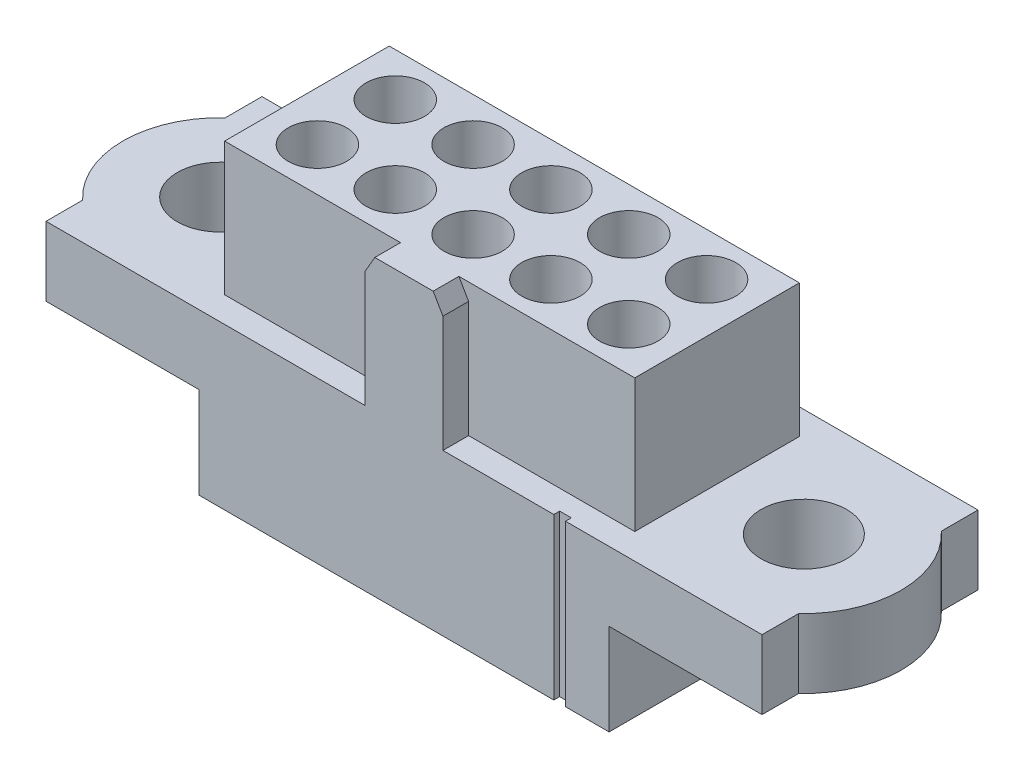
ISO-10303-21;
HEADER;
FILE_DESCRIPTION(('STEP AP214'),'2;1');
FILE_NAME('part.step','',(''),(''),'','','');
FILE_SCHEMA(('AUTOMOTIVE_DESIGN { 1 0 10303 214 1 1 1 1 }'));
ENDSEC;
DATA;
#1=APPLICATION_CONTEXT('core data for automotive mechanical design processes');
#2=APPLICATION_PROTOCOL_DEFINITION('international standard','automotive_design',2000,#1);
#3=PRODUCT_CONTEXT('',#1,'mechanical');
#4=PRODUCT('Part','Part','',(#3));
#5=PRODUCT_RELATED_PRODUCT_CATEGORY('part','',(#4));
#6=PRODUCT_DEFINITION_FORMATION('','',#4);
#7=PRODUCT_DEFINITION_CONTEXT('part definition',#1,'design');
#8=PRODUCT_DEFINITION('design','',#6,#7);
#9=PRODUCT_DEFINITION_SHAPE('','',#8);
#10=(LENGTH_UNIT() NAMED_UNIT(*) SI_UNIT(.MILLI.,.METRE.));
#11=(NAMED_UNIT(*) PLANE_ANGLE_UNIT() SI_UNIT($,.RADIAN.));
#12=(NAMED_UNIT(*) SI_UNIT($,.STERADIAN.) SOLID_ANGLE_UNIT());
#13=UNCERTAINTY_MEASURE_WITH_UNIT(LENGTH_MEASURE(1.E-05),#10,'distance_accuracy_value','');
#14=(GEOMETRIC_REPRESENTATION_CONTEXT(3) GLOBAL_UNCERTAINTY_ASSIGNED_CONTEXT((#13)) GLOBAL_UNIT_ASSIGNED_CONTEXT((#10,
#11,#12)) REPRESENTATION_CONTEXT('',''));
#15=CARTESIAN_POINT('',(0.,0.,0.));
#16=DIRECTION('',(0.,0.,1.));
#17=DIRECTION('',(1.,0.,0.));
#18=AXIS2_PLACEMENT_3D('',#15,#16,#17);
#19=CARTESIAN_POINT('',(2.,-2.63483339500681,1.));
#20=DIRECTION('',(0.,1.,0.));
#21=DIRECTION('',(0.,0.,1.));
#22=AXIS2_PLACEMENT_3D('',#19,#20,#21);
#23=CONICAL_SURFACE('',#22,0.749999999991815,0.523598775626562);
#24=CARTESIAN_POINT('',(2.,-2.634833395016,1.));
#25=DIRECTION('',(0.,1.,0.));
#26=DIRECTION('',(0.,0.,1.));
#27=AXIS2_PLACEMENT_3D('',#24,#25,#26);
#28=CIRCLE('',#27,0.75);
#29=CARTESIAN_POINT('',(2.,-2.634833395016,1.75));
#30=VERTEX_POINT('',#29);
#31=EDGE_CURVE('E478',#30,#30,#28,.T.);
#32=ORIENTED_EDGE('',*,*,#31,.T.);
#33=EDGE_LOOP('',(#32));
#34=FACE_BOUND('',#33,.T.);
#35=CARTESIAN_POINT('',(2.,-2.86,1.));
#36=DIRECTION('',(0.,1.,0.));
#37=DIRECTION('',(0.,0.,1.));
#38=AXIS2_PLACEMENT_3D('',#35,#36,#37);
#39=CIRCLE('',#38,0.62);
#40=CARTESIAN_POINT('',(2.,-2.86,1.62));
#41=VERTEX_POINT('',#40);
#42=EDGE_CURVE('E448',#41,#41,#39,.F.);
#43=ORIENTED_EDGE('',*,*,#42,.T.);
#44=EDGE_LOOP('',(#43));
#45=FACE_BOUND('',#44,.T.);
#46=ADVANCED_FACE('F16',(#34,#45),#23,.F.);
#47=CARTESIAN_POINT('',(0.,-2.63483339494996,1.));
#48=DIRECTION('',(0.,1.,0.));
#49=DIRECTION('',(0.,0.,1.));
#50=AXIS2_PLACEMENT_3D('',#47,#48,#49);
#51=CONICAL_SURFACE('',#50,0.749999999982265,0.523598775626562);
#52=CARTESIAN_POINT('',(0.,-2.634833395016,1.));
#53=DIRECTION('',(0.,1.,0.));
#54=DIRECTION('',(0.,0.,1.));
#55=AXIS2_PLACEMENT_3D('',#52,#53,#54);
#56=CIRCLE('',#55,0.75);
#57=CARTESIAN_POINT('',(0.,-2.634833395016,1.75));
#58=VERTEX_POINT('',#57);
#59=EDGE_CURVE('E475',#58,#58,#56,.T.);
#60=ORIENTED_EDGE('',*,*,#59,.T.);
#61=EDGE_LOOP('',(#60));
#62=FACE_BOUND('',#61,.T.);
#63=CARTESIAN_POINT('',(0.,-2.86,1.));
#64=DIRECTION('',(0.,1.,0.));
#65=DIRECTION('',(0.,0.,1.));
#66=AXIS2_PLACEMENT_3D('',#63,#64,#65);
#67=CIRCLE('',#66,0.62);
#68=CARTESIAN_POINT('',(0.,-2.86,1.62));
#69=VERTEX_POINT('',#68);
#70=EDGE_CURVE('E445',#69,#69,#67,.F.);
#71=ORIENTED_EDGE('',*,*,#70,.T.);
#72=EDGE_LOOP('',(#71));
#73=FACE_BOUND('',#72,.T.);
#74=ADVANCED_FACE('F985',(#62,#73),#51,.F.);
#75=CARTESIAN_POINT('',(-2.,-2.63483339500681,1.));
#76=DIRECTION('',(0.,1.,0.));
#77=DIRECTION('',(0.,0.,1.));
#78=AXIS2_PLACEMENT_3D('',#75,#76,#77);
#79=CONICAL_SURFACE('',#78,0.749999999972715,0.523598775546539);
#80=CARTESIAN_POINT('',(-2.,-2.634833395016,1.));
#81=DIRECTION('',(0.,1.,0.));
#82=DIRECTION('',(0.,0.,1.));
#83=AXIS2_PLACEMENT_3D('',#80,#81,#82);
#84=CIRCLE('',#83,0.75);
#85=CARTESIAN_POINT('',(-2.,-2.634833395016,1.75));
#86=VERTEX_POINT('',#85);
#87=EDGE_CURVE('E472',#86,#86,#84,.T.);
#88=ORIENTED_EDGE('',*,*,#87,.T.);
#89=EDGE_LOOP('',(#88));
#90=FACE_BOUND('',#89,.T.);
#91=CARTESIAN_POINT('',(-2.,-2.86,1.));
#92=DIRECTION('',(0.,1.,0.));
#93=DIRECTION('',(0.,0.,1.));
#94=AXIS2_PLACEMENT_3D('',#91,#92,#93);
#95=CIRCLE('',#94,0.62);
#96=CARTESIAN_POINT('',(-2.,-2.86,1.62));
#97=VERTEX_POINT('',#96);
#98=EDGE_CURVE('E442',#97,#97,#95,.F.);
#99=ORIENTED_EDGE('',*,*,#98,.T.);
#100=EDGE_LOOP('',(#99));
#101=FACE_BOUND('',#100,.T.);
#102=ADVANCED_FACE('F982',(#90,#101),#79,.F.);
#103=CARTESIAN_POINT('',(-4.,-2.63483339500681,1.));
#104=DIRECTION('',(0.,1.,0.));
#105=DIRECTION('',(0.,0.,1.));
#106=AXIS2_PLACEMENT_3D('',#103,#104,#105);
#107=CONICAL_SURFACE('',#106,0.750000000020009,0.523598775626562);
#108=CARTESIAN_POINT('',(-4.,-2.634833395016,1.));
#109=DIRECTION('',(0.,1.,0.));
#110=DIRECTION('',(0.,0.,1.));
#111=AXIS2_PLACEMENT_3D('',#108,#109,#110);
#112=CIRCLE('',#111,0.75);
#113=CARTESIAN_POINT('',(-4.,-2.634833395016,1.75));
#114=VERTEX_POINT('',#113);
#115=EDGE_CURVE('E469',#114,#114,#112,.T.);
#116=ORIENTED_EDGE('',*,*,#115,.T.);
#117=EDGE_LOOP('',(#116));
#118=FACE_BOUND('',#117,.T.);
#119=CARTESIAN_POINT('',(-4.,-2.86,1.));
#120=DIRECTION('',(0.,1.,0.));
#121=DIRECTION('',(0.,0.,1.));
#122=AXIS2_PLACEMENT_3D('',#119,#120,#121);
#123=CIRCLE('',#122,0.62);
#124=CARTESIAN_POINT('',(-4.,-2.86,1.62));
#125=VERTEX_POINT('',#124);
#126=EDGE_CURVE('E439',#125,#125,#123,.F.);
#127=ORIENTED_EDGE('',*,*,#126,.T.);
#128=EDGE_LOOP('',(#127));
#129=FACE_BOUND('',#128,.T.);
#130=ADVANCED_FACE('F978',(#118,#129),#107,.F.);
#131=CARTESIAN_POINT('',(4.,-2.63483339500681,-1.));
#132=DIRECTION('',(0.,1.,0.));
#133=DIRECTION('',(0.,0.,1.));
#134=AXIS2_PLACEMENT_3D('',#131,#132,#133);
#135=CONICAL_SURFACE('',#134,0.750000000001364,0.523598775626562);
#136=CARTESIAN_POINT('',(4.,-2.634833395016,-1.));
#137=DIRECTION('',(0.,1.,0.));
#138=DIRECTION('',(0.,0.,1.));
#139=AXIS2_PLACEMENT_3D('',#136,#137,#138);
#140=CIRCLE('',#139,0.75);
#141=CARTESIAN_POINT('',(4.,-2.634833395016,-0.25));
#142=VERTEX_POINT('',#141);
#143=EDGE_CURVE('E466',#142,#142,#140,.T.);
#144=ORIENTED_EDGE('',*,*,#143,.T.);
#145=EDGE_LOOP('',(#144));
#146=FACE_BOUND('',#145,.T.);
#147=CARTESIAN_POINT('',(4.,-2.86,-1.));
#148=DIRECTION('',(0.,1.,0.));
#149=DIRECTION('',(0.,0.,1.));
#150=AXIS2_PLACEMENT_3D('',#147,#148,#149);
#151=CIRCLE('',#150,0.62);
#152=CARTESIAN_POINT('',(4.,-2.86,-0.38));
#153=VERTEX_POINT('',#152);
#154=EDGE_CURVE('E436',#153,#153,#151,.F.);
#155=ORIENTED_EDGE('',*,*,#154,.T.);
#156=EDGE_LOOP('',(#155));
#157=FACE_BOUND('',#156,.T.);
#158=ADVANCED_FACE('F974',(#146,#157),#135,.F.);
#159=CARTESIAN_POINT('',(2.,-2.63483339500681,-1.));
#160=DIRECTION('',(0.,1.,0.));
#161=DIRECTION('',(0.,0.,1.));
#162=AXIS2_PLACEMENT_3D('',#159,#160,#161);
#163=CONICAL_SURFACE('',#162,0.749999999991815,0.523598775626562);
#164=CARTESIAN_POINT('',(2.,-2.634833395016,-1.));
#165=DIRECTION('',(0.,1.,0.));
#166=DIRECTION('',(0.,0.,1.));
#167=AXIS2_PLACEMENT_3D('',#164,#165,#166);
#168=CIRCLE('',#167,0.75);
#169=CARTESIAN_POINT('',(2.,-2.634833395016,-0.25));
#170=VERTEX_POINT('',#169);
#171=EDGE_CURVE('E463',#170,#170,#168,.T.);
#172=ORIENTED_EDGE('',*,*,#171,.T.);
#173=EDGE_LOOP('',(#172));
#174=FACE_BOUND('',#173,.T.);
#175=CARTESIAN_POINT('',(2.,-2.86,-1.));
#176=DIRECTION('',(0.,1.,0.));
#177=DIRECTION('',(0.,0.,1.));
#178=AXIS2_PLACEMENT_3D('',#175,#176,#177);
#179=CIRCLE('',#178,0.62);
#180=CARTESIAN_POINT('',(2.,-2.86,-0.38));
#181=VERTEX_POINT('',#180);
#182=EDGE_CURVE('E433',#181,#181,#179,.F.);
#183=ORIENTED_EDGE('',*,*,#182,.T.);
#184=EDGE_LOOP('',(#183));
#185=FACE_BOUND('',#184,.T.);
#186=ADVANCED_FACE('F970',(#174,#185),#163,.F.);
#187=CARTESIAN_POINT('',(0.,-2.63483339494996,-1.));
#188=DIRECTION('',(0.,1.,0.));
#189=DIRECTION('',(0.,0.,1.));
#190=AXIS2_PLACEMENT_3D('',#187,#188,#189);
#191=CONICAL_SURFACE('',#190,0.749999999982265,0.523598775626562);
#192=CARTESIAN_POINT('',(0.,-2.634833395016,-1.));
#193=DIRECTION('',(0.,1.,0.));
#194=DIRECTION('',(0.,0.,1.));
#195=AXIS2_PLACEMENT_3D('',#192,#193,#194);
#196=CIRCLE('',#195,0.75);
#197=CARTESIAN_POINT('',(0.,-2.634833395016,-0.25));
#198=VERTEX_POINT('',#197);
#199=EDGE_CURVE('E460',#198,#198,#196,.T.);
#200=ORIENTED_EDGE('',*,*,#199,.T.);
#201=EDGE_LOOP('',(#200));
#202=FACE_BOUND('',#201,.T.);
#203=CARTESIAN_POINT('',(0.,-2.86,-1.));
#204=DIRECTION('',(0.,1.,0.));
#205=DIRECTION('',(0.,0.,1.));
#206=AXIS2_PLACEMENT_3D('',#203,#204,#205);
#207=CIRCLE('',#206,0.62);
#208=CARTESIAN_POINT('',(0.,-2.86,-0.38));
#209=VERTEX_POINT('',#208);
#210=EDGE_CURVE('E430',#209,#209,#207,.F.);
#211=ORIENTED_EDGE('',*,*,#210,.T.);
#212=EDGE_LOOP('',(#211));
#213=FACE_BOUND('',#212,.T.);
#214=ADVANCED_FACE('F966',(#202,#213),#191,.F.);
#215=CARTESIAN_POINT('',(-2.,-2.63483339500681,-1.));
#216=DIRECTION('',(0.,1.,0.));
#217=DIRECTION('',(0.,0.,1.));
#218=AXIS2_PLACEMENT_3D('',#215,#216,#217);
#219=CONICAL_SURFACE('',#218,0.749999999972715,0.523598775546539);
#220=CARTESIAN_POINT('',(-2.,-2.634833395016,-1.));
#221=DIRECTION('',(0.,1.,0.));
#222=DIRECTION('',(0.,0.,1.));
#223=AXIS2_PLACEMENT_3D('',#220,#221,#222);
#224=CIRCLE('',#223,0.75);
#225=CARTESIAN_POINT('',(-2.,-2.634833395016,-0.25));
#226=VERTEX_POINT('',#225);
#227=EDGE_CURVE('E457',#226,#226,#224,.T.);
#228=ORIENTED_EDGE('',*,*,#227,.T.);
#229=EDGE_LOOP('',(#228));
#230=FACE_BOUND('',#229,.T.);
#231=CARTESIAN_POINT('',(-2.,-2.86,-1.));
#232=DIRECTION('',(0.,1.,0.));
#233=DIRECTION('',(0.,0.,1.));
#234=AXIS2_PLACEMENT_3D('',#231,#232,#233);
#235=CIRCLE('',#234,0.62);
#236=CARTESIAN_POINT('',(-2.,-2.86,-0.38));
#237=VERTEX_POINT('',#236);
#238=EDGE_CURVE('E427',#237,#237,#235,.F.);
#239=ORIENTED_EDGE('',*,*,#238,.T.);
#240=EDGE_LOOP('',(#239));
#241=FACE_BOUND('',#240,.T.);
#242=ADVANCED_FACE('F962',(#230,#241),#219,.F.);
#243=CARTESIAN_POINT('',(-4.,-2.63483339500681,-1.));
#244=DIRECTION('',(0.,1.,0.));
#245=DIRECTION('',(0.,0.,1.));
#246=AXIS2_PLACEMENT_3D('',#243,#244,#245);
#247=CONICAL_SURFACE('',#246,0.750000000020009,0.523598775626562);
#248=CARTESIAN_POINT('',(-4.,-2.634833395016,-1.));
#249=DIRECTION('',(0.,1.,0.));
#250=DIRECTION('',(0.,0.,1.));
#251=AXIS2_PLACEMENT_3D('',#248,#249,#250);
#252=CIRCLE('',#251,0.75);
#253=CARTESIAN_POINT('',(-4.,-2.634833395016,-0.25));
#254=VERTEX_POINT('',#253);
#255=EDGE_CURVE('E451',#254,#254,#252,.T.);
#256=ORIENTED_EDGE('',*,*,#255,.T.);
#257=EDGE_LOOP('',(#256));
#258=FACE_BOUND('',#257,.T.);
#259=CARTESIAN_POINT('',(-4.,-2.86,-1.));
#260=DIRECTION('',(0.,1.,0.));
#261=DIRECTION('',(0.,0.,1.));
#262=AXIS2_PLACEMENT_3D('',#259,#260,#261);
#263=CIRCLE('',#262,0.62);
#264=CARTESIAN_POINT('',(-4.,-2.86,-0.38));
#265=VERTEX_POINT('',#264);
#266=EDGE_CURVE('E424',#265,#265,#263,.F.);
#267=ORIENTED_EDGE('',*,*,#266,.T.);
#268=EDGE_LOOP('',(#267));
#269=FACE_BOUND('',#268,.T.);
#270=ADVANCED_FACE('F958',(#258,#269),#247,.F.);
#271=CARTESIAN_POINT('',(4.,-2.63483339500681,1.));
#272=DIRECTION('',(0.,1.,0.));
#273=DIRECTION('',(0.,0.,1.));
#274=AXIS2_PLACEMENT_3D('',#271,#272,#273);
#275=CONICAL_SURFACE('',#274,0.750000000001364,0.523598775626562);
#276=CARTESIAN_POINT('',(4.,-2.634833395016,1.));
#277=DIRECTION('',(0.,1.,0.));
#278=DIRECTION('',(0.,0.,1.));
#279=AXIS2_PLACEMENT_3D('',#276,#277,#278);
#280=CIRCLE('',#279,0.75);
#281=CARTESIAN_POINT('',(4.,-2.634833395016,1.75));
#282=VERTEX_POINT('',#281);
#283=EDGE_CURVE('E454',#282,#282,#280,.T.);
#284=ORIENTED_EDGE('',*,*,#283,.T.);
#285=EDGE_LOOP('',(#284));
#286=FACE_BOUND('',#285,.T.);
#287=CARTESIAN_POINT('',(4.,-2.86,1.));
#288=DIRECTION('',(0.,1.,0.));
#289=DIRECTION('',(0.,0.,1.));
#290=AXIS2_PLACEMENT_3D('',#287,#288,#289);
#291=CIRCLE('',#290,0.62);
#292=CARTESIAN_POINT('',(4.,-2.86,1.62));
#293=VERTEX_POINT('',#292);
#294=EDGE_CURVE('E405',#293,#293,#291,.F.);
#295=ORIENTED_EDGE('',*,*,#294,.T.);
#296=EDGE_LOOP('',(#295));
#297=FACE_BOUND('',#296,.T.);
#298=ADVANCED_FACE('F954',(#286,#297),#275,.F.);
#299=CARTESIAN_POINT('',(2.,-7.9275,1.));
#300=DIRECTION('',(0.,1.,0.));
#301=DIRECTION('',(0.,0.,1.));
#302=AXIS2_PLACEMENT_3D('',#299,#300,#301);
#303=CYLINDRICAL_SURFACE('',#302,0.75);
#304=ORIENTED_EDGE('',*,*,#31,.F.);
#305=EDGE_LOOP('',(#304));
#306=FACE_BOUND('',#305,.T.);
#307=CARTESIAN_POINT('',(2.,0.,1.));
#308=DIRECTION('',(0.,1.,0.));
#309=DIRECTION('',(0.,0.,1.));
#310=AXIS2_PLACEMENT_3D('',#307,#308,#309);
#311=CIRCLE('',#310,0.75);
#312=CARTESIAN_POINT('',(2.,0.,1.75));
#313=VERTEX_POINT('',#312);
#314=EDGE_CURVE('E19',#313,#313,#311,.T.);
#315=ORIENTED_EDGE('',*,*,#314,.T.);
#316=EDGE_LOOP('',(#315));
#317=FACE_BOUND('',#316,.T.);
#318=ADVANCED_FACE('F610',(#306,#317),#303,.F.);
#319=CARTESIAN_POINT('',(0.,-7.9275,1.));
#320=DIRECTION('',(0.,1.,0.));
#321=DIRECTION('',(0.,0.,1.));
#322=AXIS2_PLACEMENT_3D('',#319,#320,#321);
#323=CYLINDRICAL_SURFACE('',#322,0.75);
#324=ORIENTED_EDGE('',*,*,#59,.F.);
#325=EDGE_LOOP('',(#324));
#326=FACE_BOUND('',#325,.T.);
#327=CARTESIAN_POINT('',(0.,0.,1.));
#328=DIRECTION('',(0.,1.,0.));
#329=DIRECTION('',(0.,0.,1.));
#330=AXIS2_PLACEMENT_3D('',#327,#328,#329);
#331=CIRCLE('',#330,0.75);
#332=CARTESIAN_POINT('',(0.,0.,1.75));
#333=VERTEX_POINT('',#332);
#334=EDGE_CURVE('E603',#333,#333,#331,.T.);
#335=ORIENTED_EDGE('',*,*,#334,.T.);
#336=EDGE_LOOP('',(#335));
#337=FACE_BOUND('',#336,.T.);
#338=ADVANCED_FACE('F947',(#326,#337),#323,.F.);
#339=CARTESIAN_POINT('',(-2.,-7.9275,1.));
#340=DIRECTION('',(0.,1.,0.));
#341=DIRECTION('',(0.,0.,1.));
#342=AXIS2_PLACEMENT_3D('',#339,#340,#341);
#343=CYLINDRICAL_SURFACE('',#342,0.75);
#344=ORIENTED_EDGE('',*,*,#87,.F.);
#345=EDGE_LOOP('',(#344));
#346=FACE_BOUND('',#345,.T.);
#347=CARTESIAN_POINT('',(-2.,0.,1.));
#348=DIRECTION('',(0.,1.,0.));
#349=DIRECTION('',(0.,0.,1.));
#350=AXIS2_PLACEMENT_3D('',#347,#348,#349);
#351=CIRCLE('',#350,0.75);
#352=CARTESIAN_POINT('',(-2.,0.,1.75));
#353=VERTEX_POINT('',#352);
#354=EDGE_CURVE('E601',#353,#353,#351,.T.);
#355=ORIENTED_EDGE('',*,*,#354,.T.);
#356=EDGE_LOOP('',(#355));
#357=FACE_BOUND('',#356,.T.);
#358=ADVANCED_FACE('F943',(#346,#357),#343,.F.);
#359=CARTESIAN_POINT('',(-4.,-7.9275,1.));
#360=DIRECTION('',(0.,1.,0.));
#361=DIRECTION('',(0.,0.,1.));
#362=AXIS2_PLACEMENT_3D('',#359,#360,#361);
#363=CYLINDRICAL_SURFACE('',#362,0.75);
#364=ORIENTED_EDGE('',*,*,#115,.F.);
#365=EDGE_LOOP('',(#364));
#366=FACE_BOUND('',#365,.T.);
#367=CARTESIAN_POINT('',(-4.,0.,1.));
#368=DIRECTION('',(0.,1.,0.));
#369=DIRECTION('',(0.,0.,1.));
#370=AXIS2_PLACEMENT_3D('',#367,#368,#369);
#371=CIRCLE('',#370,0.75);
#372=CARTESIAN_POINT('',(-4.,0.,1.75));
#373=VERTEX_POINT('',#372);
#374=EDGE_CURVE('E598',#373,#373,#371,.T.);
#375=ORIENTED_EDGE('',*,*,#374,.T.);
#376=EDGE_LOOP('',(#375));
#377=FACE_BOUND('',#376,.T.);
#378=ADVANCED_FACE('F939',(#366,#377),#363,.F.);
#379=CARTESIAN_POINT('',(4.,-7.9275,-1.));
#380=DIRECTION('',(0.,1.,0.));
#381=DIRECTION('',(0.,0.,1.));
#382=AXIS2_PLACEMENT_3D('',#379,#380,#381);
#383=CYLINDRICAL_SURFACE('',#382,0.75);
#384=ORIENTED_EDGE('',*,*,#143,.F.);
#385=EDGE_LOOP('',(#384));
#386=FACE_BOUND('',#385,.T.);
#387=CARTESIAN_POINT('',(4.,0.,-1.));
#388=DIRECTION('',(0.,1.,0.));
#389=DIRECTION('',(0.,0.,1.));
#390=AXIS2_PLACEMENT_3D('',#387,#388,#389);
#391=CIRCLE('',#390,0.75);
#392=CARTESIAN_POINT('',(4.,0.,-0.25));
#393=VERTEX_POINT('',#392);
#394=EDGE_CURVE('E595',#393,#393,#391,.T.);
#395=ORIENTED_EDGE('',*,*,#394,.T.);
#396=EDGE_LOOP('',(#395));
#397=FACE_BOUND('',#396,.T.);
#398=ADVANCED_FACE('F935',(#386,#397),#383,.F.);
#399=CARTESIAN_POINT('',(2.,-7.9275,-1.));
#400=DIRECTION('',(0.,1.,0.));
#401=DIRECTION('',(0.,0.,1.));
#402=AXIS2_PLACEMENT_3D('',#399,#400,#401);
#403=CYLINDRICAL_SURFACE('',#402,0.75);
#404=ORIENTED_EDGE('',*,*,#171,.F.);
#405=EDGE_LOOP('',(#404));
#406=FACE_BOUND('',#405,.T.);
#407=CARTESIAN_POINT('',(2.,0.,-1.));
#408=DIRECTION('',(0.,1.,0.));
#409=DIRECTION('',(0.,0.,1.));
#410=AXIS2_PLACEMENT_3D('',#407,#408,#409);
#411=CIRCLE('',#410,0.75);
#412=CARTESIAN_POINT('',(2.,0.,-0.25));
#413=VERTEX_POINT('',#412);
#414=EDGE_CURVE('E592',#413,#413,#411,.T.);
#415=ORIENTED_EDGE('',*,*,#414,.T.);
#416=EDGE_LOOP('',(#415));
#417=FACE_BOUND('',#416,.T.);
#418=ADVANCED_FACE('F931',(#406,#417),#403,.F.);
#419=CARTESIAN_POINT('',(0.,-7.9275,-1.));
#420=DIRECTION('',(0.,1.,0.));
#421=DIRECTION('',(0.,0.,1.));
#422=AXIS2_PLACEMENT_3D('',#419,#420,#421);
#423=CYLINDRICAL_SURFACE('',#422,0.75);
#424=ORIENTED_EDGE('',*,*,#199,.F.);
#425=EDGE_LOOP('',(#424));
#426=FACE_BOUND('',#425,.T.);
#427=CARTESIAN_POINT('',(0.,0.,-1.));
#428=DIRECTION('',(0.,1.,0.));
#429=DIRECTION('',(0.,0.,1.));
#430=AXIS2_PLACEMENT_3D('',#427,#428,#429);
#431=CIRCLE('',#430,0.75);
#432=CARTESIAN_POINT('',(0.,0.,-0.25));
#433=VERTEX_POINT('',#432);
#434=EDGE_CURVE('E589',#433,#433,#431,.T.);
#435=ORIENTED_EDGE('',*,*,#434,.T.);
#436=EDGE_LOOP('',(#435));
#437=FACE_BOUND('',#436,.T.);
#438=ADVANCED_FACE('F927',(#426,#437),#423,.F.);
#439=CARTESIAN_POINT('',(-2.,-7.9275,-1.));
#440=DIRECTION('',(0.,1.,0.));
#441=DIRECTION('',(0.,0.,1.));
#442=AXIS2_PLACEMENT_3D('',#439,#440,#441);
#443=CYLINDRICAL_SURFACE('',#442,0.75);
#444=ORIENTED_EDGE('',*,*,#227,.F.);
#445=EDGE_LOOP('',(#444));
#446=FACE_BOUND('',#445,.T.);
#447=CARTESIAN_POINT('',(-2.,0.,-1.));
#448=DIRECTION('',(0.,1.,0.));
#449=DIRECTION('',(0.,0.,1.));
#450=AXIS2_PLACEMENT_3D('',#447,#448,#449);
#451=CIRCLE('',#450,0.75);
#452=CARTESIAN_POINT('',(-2.,0.,-0.25));
#453=VERTEX_POINT('',#452);
#454=EDGE_CURVE('E586',#453,#453,#451,.T.);
#455=ORIENTED_EDGE('',*,*,#454,.T.);
#456=EDGE_LOOP('',(#455));
#457=FACE_BOUND('',#456,.T.);
#458=ADVANCED_FACE('F923',(#446,#457),#443,.F.);
#459=CARTESIAN_POINT('',(4.,-7.9275,1.));
#460=DIRECTION('',(0.,1.,0.));
#461=DIRECTION('',(0.,0.,1.));
#462=AXIS2_PLACEMENT_3D('',#459,#460,#461);
#463=CYLINDRICAL_SURFACE('',#462,0.75);
#464=ORIENTED_EDGE('',*,*,#283,.F.);
#465=EDGE_LOOP('',(#464));
#466=FACE_BOUND('',#465,.T.);
#467=CARTESIAN_POINT('',(4.,0.,1.));
#468=DIRECTION('',(0.,1.,0.));
#469=DIRECTION('',(0.,0.,1.));
#470=AXIS2_PLACEMENT_3D('',#467,#468,#469);
#471=CIRCLE('',#470,0.75);
#472=CARTESIAN_POINT('',(4.,0.,1.75));
#473=VERTEX_POINT('',#472);
#474=EDGE_CURVE('E583',#473,#473,#471,.T.);
#475=ORIENTED_EDGE('',*,*,#474,.T.);
#476=EDGE_LOOP('',(#475));
#477=FACE_BOUND('',#476,.T.);
#478=ADVANCED_FACE('F919',(#466,#477),#463,.F.);
#479=CARTESIAN_POINT('',(-4.,-7.9275,-1.));
#480=DIRECTION('',(0.,1.,0.));
#481=DIRECTION('',(0.,0.,1.));
#482=AXIS2_PLACEMENT_3D('',#479,#480,#481);
#483=CYLINDRICAL_SURFACE('',#482,0.75);
#484=ORIENTED_EDGE('',*,*,#255,.F.);
#485=EDGE_LOOP('',(#484));
#486=FACE_BOUND('',#485,.T.);
#487=CARTESIAN_POINT('',(-4.,0.,-1.));
#488=DIRECTION('',(0.,1.,0.));
#489=DIRECTION('',(0.,0.,1.));
#490=AXIS2_PLACEMENT_3D('',#487,#488,#489);
#491=CIRCLE('',#490,0.75);
#492=CARTESIAN_POINT('',(-4.,0.,-0.25));
#493=VERTEX_POINT('',#492);
#494=EDGE_CURVE('E381',#493,#493,#491,.T.);
#495=ORIENTED_EDGE('',*,*,#494,.T.);
#496=EDGE_LOOP('',(#495));
#497=FACE_BOUND('',#496,.T.);
#498=ADVANCED_FACE('F915',(#486,#497),#483,.F.);
#499=CARTESIAN_POINT('',(2.,-7.9275,1.));
#500=DIRECTION('',(0.,1.,0.));
#501=DIRECTION('',(0.,0.,1.));
#502=AXIS2_PLACEMENT_3D('',#499,#500,#501);
#503=CYLINDRICAL_SURFACE('',#502,0.62);
#504=ORIENTED_EDGE('',*,*,#42,.F.);
#505=EDGE_LOOP('',(#504));
#506=FACE_BOUND('',#505,.T.);
#507=CARTESIAN_POINT('',(2.,-3.6,1.));
#508=DIRECTION('',(0.,1.,0.));
#509=DIRECTION('',(0.,0.,1.));
#510=AXIS2_PLACEMENT_3D('',#507,#508,#509);
#511=CIRCLE('',#510,0.62);
#512=CARTESIAN_POINT('',(2.,-3.6,1.62));
#513=VERTEX_POINT('',#512);
#514=EDGE_CURVE('E369',#513,#513,#511,.F.);
#515=ORIENTED_EDGE('',*,*,#514,.T.);
#516=EDGE_LOOP('',(#515));
#517=FACE_BOUND('',#516,.T.);
#518=ADVANCED_FACE('F911',(#506,#517),#503,.F.);
#519=CARTESIAN_POINT('',(0.,-7.9275,1.));
#520=DIRECTION('',(0.,1.,0.));
#521=DIRECTION('',(0.,0.,1.));
#522=AXIS2_PLACEMENT_3D('',#519,#520,#521);
#523=CYLINDRICAL_SURFACE('',#522,0.62);
#524=ORIENTED_EDGE('',*,*,#70,.F.);
#525=EDGE_LOOP('',(#524));
#526=FACE_BOUND('',#525,.T.);
#527=CARTESIAN_POINT('',(0.,-3.6,1.));
#528=DIRECTION('',(0.,1.,0.));
#529=DIRECTION('',(0.,0.,1.));
#530=AXIS2_PLACEMENT_3D('',#527,#528,#529);
#531=CIRCLE('',#530,0.62);
#532=CARTESIAN_POINT('',(0.,-3.6,1.62));
#533=VERTEX_POINT('',#532);
#534=EDGE_CURVE('E576',#533,#533,#531,.F.);
#535=ORIENTED_EDGE('',*,*,#534,.T.);
#536=EDGE_LOOP('',(#535));
#537=FACE_BOUND('',#536,.T.);
#538=ADVANCED_FACE('F907',(#526,#537),#523,.F.);
#539=CARTESIAN_POINT('',(-2.,-7.9275,1.));
#540=DIRECTION('',(0.,1.,0.));
#541=DIRECTION('',(0.,0.,1.));
#542=AXIS2_PLACEMENT_3D('',#539,#540,#541);
#543=CYLINDRICAL_SURFACE('',#542,0.62);
#544=ORIENTED_EDGE('',*,*,#98,.F.);
#545=EDGE_LOOP('',(#544));
#546=FACE_BOUND('',#545,.T.);
#547=CARTESIAN_POINT('',(-2.,-3.6,1.));
#548=DIRECTION('',(0.,1.,0.));
#549=DIRECTION('',(0.,0.,1.));
#550=AXIS2_PLACEMENT_3D('',#547,#548,#549);
#551=CIRCLE('',#550,0.62);
#552=CARTESIAN_POINT('',(-2.,-3.6,1.62));
#553=VERTEX_POINT('',#552);
#554=EDGE_CURVE('E573',#553,#553,#551,.F.);
#555=ORIENTED_EDGE('',*,*,#554,.T.);
#556=EDGE_LOOP('',(#555));
#557=FACE_BOUND('',#556,.T.);
#558=ADVANCED_FACE('F903',(#546,#557),#543,.F.);
#559=CARTESIAN_POINT('',(-4.,-7.9275,1.));
#560=DIRECTION('',(0.,1.,0.));
#561=DIRECTION('',(0.,0.,1.));
#562=AXIS2_PLACEMENT_3D('',#559,#560,#561);
#563=CYLINDRICAL_SURFACE('',#562,0.62);
#564=ORIENTED_EDGE('',*,*,#126,.F.);
#565=EDGE_LOOP('',(#564));
#566=FACE_BOUND('',#565,.T.);
#567=CARTESIAN_POINT('',(-4.,-3.6,1.));
#568=DIRECTION('',(0.,1.,0.));
#569=DIRECTION('',(0.,0.,1.));
#570=AXIS2_PLACEMENT_3D('',#567,#568,#569);
#571=CIRCLE('',#570,0.62);
#572=CARTESIAN_POINT('',(-4.,-3.6,1.62));
#573=VERTEX_POINT('',#572);
#574=EDGE_CURVE('E570',#573,#573,#571,.F.);
#575=ORIENTED_EDGE('',*,*,#574,.T.);
#576=EDGE_LOOP('',(#575));
#577=FACE_BOUND('',#576,.T.);
#578=ADVANCED_FACE('F899',(#566,#577),#563,.F.);
#579=CARTESIAN_POINT('',(4.,-7.9275,-1.));
#580=DIRECTION('',(0.,1.,0.));
#581=DIRECTION('',(0.,0.,1.));
#582=AXIS2_PLACEMENT_3D('',#579,#580,#581);
#583=CYLINDRICAL_SURFACE('',#582,0.62);
#584=ORIENTED_EDGE('',*,*,#154,.F.);
#585=EDGE_LOOP('',(#584));
#586=FACE_BOUND('',#585,.T.);
#587=CARTESIAN_POINT('',(4.,-3.6,-1.));
#588=DIRECTION('',(0.,1.,0.));
#589=DIRECTION('',(0.,0.,1.));
#590=AXIS2_PLACEMENT_3D('',#587,#588,#589);
#591=CIRCLE('',#590,0.62);
#592=CARTESIAN_POINT('',(4.,-3.6,-0.38));
#593=VERTEX_POINT('',#592);
#594=EDGE_CURVE('E567',#593,#593,#591,.F.);
#595=ORIENTED_EDGE('',*,*,#594,.T.);
#596=EDGE_LOOP('',(#595));
#597=FACE_BOUND('',#596,.T.);
#598=ADVANCED_FACE('F895',(#586,#597),#583,.F.);
#599=CARTESIAN_POINT('',(2.,-7.9275,-1.));
#600=DIRECTION('',(0.,1.,0.));
#601=DIRECTION('',(0.,0.,1.));
#602=AXIS2_PLACEMENT_3D('',#599,#600,#601);
#603=CYLINDRICAL_SURFACE('',#602,0.62);
#604=ORIENTED_EDGE('',*,*,#182,.F.);
#605=EDGE_LOOP('',(#604));
#606=FACE_BOUND('',#605,.T.);
#607=CARTESIAN_POINT('',(2.,-3.6,-1.));
#608=DIRECTION('',(0.,1.,0.));
#609=DIRECTION('',(0.,0.,1.));
#610=AXIS2_PLACEMENT_3D('',#607,#608,#609);
#611=CIRCLE('',#610,0.62);
#612=CARTESIAN_POINT('',(2.,-3.6,-0.38));
#613=VERTEX_POINT('',#612);
#614=EDGE_CURVE('E564',#613,#613,#611,.F.);
#615=ORIENTED_EDGE('',*,*,#614,.T.);
#616=EDGE_LOOP('',(#615));
#617=FACE_BOUND('',#616,.T.);
#618=ADVANCED_FACE('F891',(#606,#617),#603,.F.);
#619=CARTESIAN_POINT('',(0.,-7.9275,-1.));
#620=DIRECTION('',(0.,1.,0.));
#621=DIRECTION('',(0.,0.,1.));
#622=AXIS2_PLACEMENT_3D('',#619,#620,#621);
#623=CYLINDRICAL_SURFACE('',#622,0.62);
#624=ORIENTED_EDGE('',*,*,#210,.F.);
#625=EDGE_LOOP('',(#624));
#626=FACE_BOUND('',#625,.T.);
#627=CARTESIAN_POINT('',(0.,-3.6,-1.));
#628=DIRECTION('',(0.,1.,0.));
#629=DIRECTION('',(0.,0.,1.));
#630=AXIS2_PLACEMENT_3D('',#627,#628,#629);
#631=CIRCLE('',#630,0.62);
#632=CARTESIAN_POINT('',(0.,-3.6,-0.38));
#633=VERTEX_POINT('',#632);
#634=EDGE_CURVE('E561',#633,#633,#631,.F.);
#635=ORIENTED_EDGE('',*,*,#634,.T.);
#636=EDGE_LOOP('',(#635));
#637=FACE_BOUND('',#636,.T.);
#638=ADVANCED_FACE('F887',(#626,#637),#623,.F.);
#639=CARTESIAN_POINT('',(-2.,-7.9275,-1.));
#640=DIRECTION('',(0.,1.,0.));
#641=DIRECTION('',(0.,0.,1.));
#642=AXIS2_PLACEMENT_3D('',#639,#640,#641);
#643=CYLINDRICAL_SURFACE('',#642,0.62);
#644=ORIENTED_EDGE('',*,*,#238,.F.);
#645=EDGE_LOOP('',(#644));
#646=FACE_BOUND('',#645,.T.);
#647=CARTESIAN_POINT('',(-2.,-3.6,-1.));
#648=DIRECTION('',(0.,1.,0.));
#649=DIRECTION('',(0.,0.,1.));
#650=AXIS2_PLACEMENT_3D('',#647,#648,#649);
#651=CIRCLE('',#650,0.62);
#652=CARTESIAN_POINT('',(-2.,-3.6,-0.38));
#653=VERTEX_POINT('',#652);
#654=EDGE_CURVE('E558',#653,#653,#651,.F.);
#655=ORIENTED_EDGE('',*,*,#654,.T.);
#656=EDGE_LOOP('',(#655));
#657=FACE_BOUND('',#656,.T.);
#658=ADVANCED_FACE('F883',(#646,#657),#643,.F.);
#659=CARTESIAN_POINT('',(-4.,-7.9275,-1.));
#660=DIRECTION('',(0.,1.,0.));
#661=DIRECTION('',(0.,0.,1.));
#662=AXIS2_PLACEMENT_3D('',#659,#660,#661);
#663=CYLINDRICAL_SURFACE('',#662,0.62);
#664=ORIENTED_EDGE('',*,*,#266,.F.);
#665=EDGE_LOOP('',(#664));
#666=FACE_BOUND('',#665,.T.);
#667=CARTESIAN_POINT('',(-4.,-3.6,-1.));
#668=DIRECTION('',(0.,1.,0.));
#669=DIRECTION('',(0.,0.,1.));
#670=AXIS2_PLACEMENT_3D('',#667,#668,#669);
#671=CIRCLE('',#670,0.62);
#672=CARTESIAN_POINT('',(-4.,-3.6,-0.38));
#673=VERTEX_POINT('',#672);
#674=EDGE_CURVE('E555',#673,#673,#671,.F.);
#675=ORIENTED_EDGE('',*,*,#674,.T.);
#676=EDGE_LOOP('',(#675));
#677=FACE_BOUND('',#676,.T.);
#678=ADVANCED_FACE('F879',(#666,#677),#663,.F.);
#679=CARTESIAN_POINT('',(4.,-7.9275,1.));
#680=DIRECTION('',(0.,1.,0.));
#681=DIRECTION('',(0.,0.,1.));
#682=AXIS2_PLACEMENT_3D('',#679,#680,#681);
#683=CYLINDRICAL_SURFACE('',#682,0.62);
#684=ORIENTED_EDGE('',*,*,#294,.F.);
#685=EDGE_LOOP('',(#684));
#686=FACE_BOUND('',#685,.T.);
#687=CARTESIAN_POINT('',(4.,-3.6,1.));
#688=DIRECTION('',(0.,1.,0.));
#689=DIRECTION('',(0.,0.,1.));
#690=AXIS2_PLACEMENT_3D('',#687,#688,#689);
#691=CIRCLE('',#690,0.62);
#692=CARTESIAN_POINT('',(4.,-3.6,1.62));
#693=VERTEX_POINT('',#692);
#694=EDGE_CURVE('E366',#693,#693,#691,.F.);
#695=ORIENTED_EDGE('',*,*,#694,.T.);
#696=EDGE_LOOP('',(#695));
#697=FACE_BOUND('',#696,.T.);
#698=ADVANCED_FACE('F875',(#686,#697),#683,.F.);
#699=CARTESIAN_POINT('',(4.15,-3.42,2.625));
#700=DIRECTION('',(0.,0.,-1.));
#701=DIRECTION('',(-1.,0.,0.));
#702=AXIS2_PLACEMENT_3D('',#699,#700,#701);
#703=PLANE('',#702);
#704=DIRECTION('',(-1.,0.,0.));
#705=VECTOR('',#704,1.);
#706=CARTESIAN_POINT('',(4.15,-3.42,2.625));
#707=LINE('',#706,#705);
#708=CARTESIAN_POINT('',(3.85,-3.42,2.625));
#709=VERTEX_POINT('',#708);
#710=CARTESIAN_POINT('',(4.15,-3.42,2.625));
#711=VERTEX_POINT('',#710);
#712=EDGE_CURVE('E386',#709,#711,#707,.F.);
#713=ORIENTED_EDGE('',*,*,#712,.F.);
#714=DIRECTION('',(0.,1.,0.));
#715=VECTOR('',#714,1.);
#716=CARTESIAN_POINT('',(3.85,-3.42,2.625));
#717=LINE('',#716,#715);
#718=CARTESIAN_POINT('',(3.85,-7.55,2.625));
#719=VERTEX_POINT('',#718);
#720=EDGE_CURVE('E339',#709,#719,#717,.F.);
#721=ORIENTED_EDGE('',*,*,#720,.T.);
#722=DIRECTION('',(-1.,0.,0.));
#723=VECTOR('',#722,1.);
#724=CARTESIAN_POINT('',(4.15,-7.55,2.625));
#725=LINE('',#724,#723);
#726=CARTESIAN_POINT('',(4.15,-7.55,2.625));
#727=VERTEX_POINT('',#726);
#728=EDGE_CURVE('E403',#727,#719,#725,.T.);
#729=ORIENTED_EDGE('',*,*,#728,.F.);
#730=DIRECTION('',(0.,1.,0.));
#731=VECTOR('',#730,1.);
#732=CARTESIAN_POINT('',(4.15,-3.42,2.625));
#733=LINE('',#732,#731);
#734=EDGE_CURVE('E370',#727,#711,#733,.T.);
#735=ORIENTED_EDGE('',*,*,#734,.T.);
#736=EDGE_LOOP('',(#713,#721,#729,#735));
#737=FACE_BOUND('',#736,.T.);
#738=ADVANCED_FACE('F616',(#737),#703,.F.);
#739=CARTESIAN_POINT('',(0.,0.,0.));
#740=DIRECTION('',(0.,-1.,0.));
#741=DIRECTION('',(0.,0.,-1.));
#742=AXIS2_PLACEMENT_3D('',#739,#740,#741);
#743=PLANE('',#742);
#744=ORIENTED_EDGE('',*,*,#494,.F.);
#745=EDGE_LOOP('',(#744));
#746=FACE_BOUND('',#745,.T.);
#747=ORIENTED_EDGE('',*,*,#474,.F.);
#748=EDGE_LOOP('',(#747));
#749=FACE_BOUND('',#748,.T.);
#750=ORIENTED_EDGE('',*,*,#454,.F.);
#751=EDGE_LOOP('',(#750));
#752=FACE_BOUND('',#751,.T.);
#753=ORIENTED_EDGE('',*,*,#434,.F.);
#754=EDGE_LOOP('',(#753));
#755=FACE_BOUND('',#754,.T.);
#756=ORIENTED_EDGE('',*,*,#414,.F.);
#757=EDGE_LOOP('',(#756));
#758=FACE_BOUND('',#757,.T.);
#759=ORIENTED_EDGE('',*,*,#394,.F.);
#760=EDGE_LOOP('',(#759));
#761=FACE_BOUND('',#760,.T.);
#762=ORIENTED_EDGE('',*,*,#374,.F.);
#763=EDGE_LOOP('',(#762));
#764=FACE_BOUND('',#763,.T.);
#765=ORIENTED_EDGE('',*,*,#354,.F.);
#766=EDGE_LOOP('',(#765));
#767=FACE_BOUND('',#766,.T.);
#768=ORIENTED_EDGE('',*,*,#334,.F.);
#769=EDGE_LOOP('',(#768));
#770=FACE_BOUND('',#769,.T.);
#771=ORIENTED_EDGE('',*,*,#314,.F.);
#772=EDGE_LOOP('',(#771));
#773=FACE_BOUND('',#772,.T.);
#774=DIRECTION('',(-1.,0.,0.));
#775=VECTOR('',#774,1.);
#776=CARTESIAN_POINT('',(-5.27,0.,-2.115));
#777=LINE('',#776,#775);
#778=CARTESIAN_POINT('',(-5.27,0.,-2.115));
#779=VERTEX_POINT('',#778);
#780=CARTESIAN_POINT('',(5.27,0.,-2.115));
#781=VERTEX_POINT('',#780);
#782=EDGE_CURVE('E319',#779,#781,#777,.F.);
#783=ORIENTED_EDGE('',*,*,#782,.F.);
#784=DIRECTION('',(0.,0.,1.));
#785=VECTOR('',#784,1.);
#786=CARTESIAN_POINT('',(-5.27,0.,2.115));
#787=LINE('',#786,#785);
#788=CARTESIAN_POINT('',(-5.27,0.,2.115));
#789=VERTEX_POINT('',#788);
#790=EDGE_CURVE('E313',#789,#779,#787,.F.);
#791=ORIENTED_EDGE('',*,*,#790,.F.);
#792=DIRECTION('',(1.,0.,0.));
#793=VECTOR('',#792,1.);
#794=CARTESIAN_POINT('',(5.27,0.,2.115));
#795=LINE('',#794,#793);
#796=CARTESIAN_POINT('',(-0.75,0.,2.115));
#797=VERTEX_POINT('',#796);
#798=EDGE_CURVE('E304',#797,#789,#795,.F.);
#799=ORIENTED_EDGE('',*,*,#798,.F.);
#800=DIRECTION('',(0.,0.,1.));
#801=VECTOR('',#800,1.);
#802=CARTESIAN_POINT('',(-0.75,0.,2.775));
#803=LINE('',#802,#801);
#804=CARTESIAN_POINT('',(-0.75,0.,2.775));
#805=VERTEX_POINT('',#804);
#806=EDGE_CURVE('E356',#805,#797,#803,.F.);
#807=ORIENTED_EDGE('',*,*,#806,.F.);
#808=DIRECTION('',(1.,0.,0.));
#809=VECTOR('',#808,1.);
#810=CARTESIAN_POINT('',(0.,0.,2.775));
#811=LINE('',#810,#809);
#812=CARTESIAN_POINT('',(0.75,0.,2.775));
#813=VERTEX_POINT('',#812);
#814=EDGE_CURVE('E384',#813,#805,#811,.F.);
#815=ORIENTED_EDGE('',*,*,#814,.F.);
#816=DIRECTION('',(0.,0.,1.));
#817=VECTOR('',#816,1.);
#818=CARTESIAN_POINT('',(0.75,0.,2.775));
#819=LINE('',#818,#817);
#820=CARTESIAN_POINT('',(0.75,0.,2.115));
#821=VERTEX_POINT('',#820);
#822=EDGE_CURVE('E361',#821,#813,#819,.T.);
#823=ORIENTED_EDGE('',*,*,#822,.F.);
#824=DIRECTION('',(1.,0.,0.));
#825=VECTOR('',#824,1.);
#826=CARTESIAN_POINT('',(5.27,0.,2.115));
#827=LINE('',#826,#825);
#828=CARTESIAN_POINT('',(5.27,0.,2.115));
#829=VERTEX_POINT('',#828);
#830=EDGE_CURVE('E331',#829,#821,#827,.F.);
#831=ORIENTED_EDGE('',*,*,#830,.F.);
#832=DIRECTION('',(0.,0.,-1.));
#833=VECTOR('',#832,1.);
#834=CARTESIAN_POINT('',(5.27,0.,-2.115));
#835=LINE('',#834,#833);
#836=EDGE_CURVE('E325',#781,#829,#835,.F.);
#837=ORIENTED_EDGE('',*,*,#836,.F.);
#838=EDGE_LOOP('',(#783,#791,#799,#807,#815,#823,#831,#837));
#839=FACE_BOUND('',#838,.T.);
#840=ADVANCED_FACE('F612',(#746,#749,#752,#755,#758,#761,#764,#767,#770,#773,#839),#743,.F.);
#841=CARTESIAN_POINT('',(9.2,-3.42,1.833030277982));
#842=DIRECTION('',(1.,0.,0.));
#843=DIRECTION('',(0.,0.,-1.));
#844=AXIS2_PLACEMENT_3D('',#841,#842,#843);
#845=PLANE('',#844);
#846=DIRECTION('',(0.,-1.,0.));
#847=VECTOR('',#846,1.);
#848=CARTESIAN_POINT('',(9.20000000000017,-3.42,1.83303027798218));
#849=LINE('',#848,#847);
#850=CARTESIAN_POINT('',(9.20000000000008,-3.42,1.83303027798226));
#851=VERTEX_POINT('',#850);
#852=CARTESIAN_POINT('',(9.20000000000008,-5.2,1.83303027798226));
#853=VERTEX_POINT('',#852);
#854=EDGE_CURVE('E272',#851,#853,#849,.T.);
#855=ORIENTED_EDGE('',*,*,#854,.F.);
#856=DIRECTION('',(0.,0.,-1.));
#857=VECTOR('',#856,1.);
#858=CARTESIAN_POINT('',(9.2,-3.42,1.833030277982));
#859=LINE('',#858,#857);
#860=CARTESIAN_POINT('',(9.2,-3.42,2.775));
#861=VERTEX_POINT('',#860);
#862=EDGE_CURVE('E375',#851,#861,#859,.F.);
#863=ORIENTED_EDGE('',*,*,#862,.T.);
#864=DIRECTION('',(0.,1.,0.));
#865=VECTOR('',#864,1.);
#866=CARTESIAN_POINT('',(9.2,-3.42,2.775));
#867=LINE('',#866,#865);
#868=CARTESIAN_POINT('',(9.2,-5.2,2.775));
#869=VERTEX_POINT('',#868);
#870=EDGE_CURVE('E269',#869,#861,#867,.T.);
#871=ORIENTED_EDGE('',*,*,#870,.F.);
#872=DIRECTION('',(0.,0.,-1.));
#873=VECTOR('',#872,1.);
#874=CARTESIAN_POINT('',(9.2,-5.2,1.833030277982));
#875=LINE('',#874,#873);
#876=EDGE_CURVE('E377',#869,#853,#875,.T.);
#877=ORIENTED_EDGE('',*,*,#876,.T.);
#878=EDGE_LOOP('',(#855,#863,#871,#877));
#879=FACE_BOUND('',#878,.T.);
#880=ADVANCED_FACE('F615',(#879),#845,.T.);
#881=CARTESIAN_POINT('',(4.15,-3.42,2.925));
#882=DIRECTION('',(1.,0.,0.));
#883=DIRECTION('',(0.,0.,-1.));
#884=AXIS2_PLACEMENT_3D('',#881,#882,#883);
#885=PLANE('',#884);
#886=DIRECTION('',(0.,0.,-1.));
#887=VECTOR('',#886,1.);
#888=CARTESIAN_POINT('',(4.15,-3.42,2.925));
#889=LINE('',#888,#887);
#890=CARTESIAN_POINT('',(4.15,-3.42,2.775));
#891=VERTEX_POINT('',#890);
#892=EDGE_CURVE('E367',#711,#891,#889,.F.);
#893=ORIENTED_EDGE('',*,*,#892,.F.);
#894=ORIENTED_EDGE('',*,*,#734,.F.);
#895=DIRECTION('',(0.,0.,-1.));
#896=VECTOR('',#895,1.);
#897=CARTESIAN_POINT('',(4.15,-7.55,2.925));
#898=LINE('',#897,#896);
#899=CARTESIAN_POINT('',(4.15,-7.55,2.775));
#900=VERTEX_POINT('',#899);
#901=EDGE_CURVE('E373',#900,#727,#898,.T.);
#902=ORIENTED_EDGE('',*,*,#901,.F.);
#903=DIRECTION('',(0.,1.,0.));
#904=VECTOR('',#903,1.);
#905=CARTESIAN_POINT('',(4.15,-3.42,2.775));
#906=LINE('',#905,#904);
#907=EDGE_CURVE('E265',#891,#900,#906,.F.);
#908=ORIENTED_EDGE('',*,*,#907,.F.);
#909=EDGE_LOOP('',(#893,#894,#902,#908));
#910=FACE_BOUND('',#909,.T.);
#911=ADVANCED_FACE('F866',(#910),#885,.F.);
#912=CARTESIAN_POINT('',(2.,-3.6,1.));
#913=DIRECTION('',(0.,1.,0.));
#914=DIRECTION('',(0.,0.,1.));
#915=AXIS2_PLACEMENT_3D('',#912,#913,#914);
#916=PLANE('',#915);
#917=ORIENTED_EDGE('',*,*,#514,.F.);
#918=EDGE_LOOP('',(#917));
#919=FACE_BOUND('',#918,.T.);
#920=CARTESIAN_POINT('',(2.,-3.6,1.));
#921=DIRECTION('',(0.,1.,0.));
#922=DIRECTION('',(0.,0.,1.));
#923=AXIS2_PLACEMENT_3D('',#920,#921,#922);
#924=CIRCLE('',#923,0.795);
#925=CARTESIAN_POINT('',(2.,-3.6,1.795));
#926=VERTEX_POINT('',#925);
#927=EDGE_CURVE('E268',#926,#926,#924,.F.);
#928=ORIENTED_EDGE('',*,*,#927,.T.);
#929=EDGE_LOOP('',(#928));
#930=FACE_BOUND('',#929,.T.);
#931=ADVANCED_FACE('F862',(#919,#930),#916,.F.);
#932=CARTESIAN_POINT('',(0.,-3.6,1.));
#933=DIRECTION('',(0.,1.,0.));
#934=DIRECTION('',(0.,0.,1.));
#935=AXIS2_PLACEMENT_3D('',#932,#933,#934);
#936=PLANE('',#935);
#937=ORIENTED_EDGE('',*,*,#534,.F.);
#938=EDGE_LOOP('',(#937));
#939=FACE_BOUND('',#938,.T.);
#940=CARTESIAN_POINT('',(0.,-3.6,1.));
#941=DIRECTION('',(0.,1.,0.));
#942=DIRECTION('',(0.,0.,1.));
#943=AXIS2_PLACEMENT_3D('',#940,#941,#942);
#944=CIRCLE('',#943,0.795);
#945=CARTESIAN_POINT('',(0.,-3.6,1.795));
#946=VERTEX_POINT('',#945);
#947=EDGE_CURVE('E548',#946,#946,#944,.F.);
#948=ORIENTED_EDGE('',*,*,#947,.T.);
#949=EDGE_LOOP('',(#948));
#950=FACE_BOUND('',#949,.T.);
#951=ADVANCED_FACE('F858',(#939,#950),#936,.F.);
#952=CARTESIAN_POINT('',(-2.,-3.6,1.));
#953=DIRECTION('',(0.,1.,0.));
#954=DIRECTION('',(0.,0.,1.));
#955=AXIS2_PLACEMENT_3D('',#952,#953,#954);
#956=PLANE('',#955);
#957=ORIENTED_EDGE('',*,*,#554,.F.);
#958=EDGE_LOOP('',(#957));
#959=FACE_BOUND('',#958,.T.);
#960=CARTESIAN_POINT('',(-2.,-3.6,1.));
#961=DIRECTION('',(0.,1.,0.));
#962=DIRECTION('',(0.,0.,1.));
#963=AXIS2_PLACEMENT_3D('',#960,#961,#962);
#964=CIRCLE('',#963,0.795);
#965=CARTESIAN_POINT('',(-2.,-3.6,1.795));
#966=VERTEX_POINT('',#965);
#967=EDGE_CURVE('E545',#966,#966,#964,.F.);
#968=ORIENTED_EDGE('',*,*,#967,.T.);
#969=EDGE_LOOP('',(#968));
#970=FACE_BOUND('',#969,.T.);
#971=ADVANCED_FACE('F854',(#959,#970),#956,.F.);
#972=CARTESIAN_POINT('',(-4.,-3.6,1.));
#973=DIRECTION('',(0.,1.,0.));
#974=DIRECTION('',(0.,0.,1.));
#975=AXIS2_PLACEMENT_3D('',#972,#973,#974);
#976=PLANE('',#975);
#977=ORIENTED_EDGE('',*,*,#574,.F.);
#978=EDGE_LOOP('',(#977));
#979=FACE_BOUND('',#978,.T.);
#980=CARTESIAN_POINT('',(-4.,-3.6,1.));
#981=DIRECTION('',(0.,1.,0.));
#982=DIRECTION('',(0.,0.,1.));
#983=AXIS2_PLACEMENT_3D('',#980,#981,#982);
#984=CIRCLE('',#983,0.795);
#985=CARTESIAN_POINT('',(-4.,-3.6,1.795));
#986=VERTEX_POINT('',#985);
#987=EDGE_CURVE('E542',#986,#986,#984,.F.);
#988=ORIENTED_EDGE('',*,*,#987,.T.);
#989=EDGE_LOOP('',(#988));
#990=FACE_BOUND('',#989,.T.);
#991=ADVANCED_FACE('F850',(#979,#990),#976,.F.);
#992=CARTESIAN_POINT('',(4.,-3.6,-1.));
#993=DIRECTION('',(0.,1.,0.));
#994=DIRECTION('',(0.,0.,1.));
#995=AXIS2_PLACEMENT_3D('',#992,#993,#994);
#996=PLANE('',#995);
#997=ORIENTED_EDGE('',*,*,#594,.F.);
#998=EDGE_LOOP('',(#997));
#999=FACE_BOUND('',#998,.T.);
#1000=CARTESIAN_POINT('',(4.,-3.6,-1.));
#1001=DIRECTION('',(0.,1.,0.));
#1002=DIRECTION('',(0.,0.,1.));
#1003=AXIS2_PLACEMENT_3D('',#1000,#1001,#1002);
#1004=CIRCLE('',#1003,0.795);
#1005=CARTESIAN_POINT('',(4.,-3.6,-0.205));
#1006=VERTEX_POINT('',#1005);
#1007=EDGE_CURVE('E539',#1006,#1006,#1004,.F.);
#1008=ORIENTED_EDGE('',*,*,#1007,.T.);
#1009=EDGE_LOOP('',(#1008));
#1010=FACE_BOUND('',#1009,.T.);
#1011=ADVANCED_FACE('F846',(#999,#1010),#996,.F.);
#1012=CARTESIAN_POINT('',(2.,-3.6,-1.));
#1013=DIRECTION('',(0.,1.,0.));
#1014=DIRECTION('',(0.,0.,1.));
#1015=AXIS2_PLACEMENT_3D('',#1012,#1013,#1014);
#1016=PLANE('',#1015);
#1017=ORIENTED_EDGE('',*,*,#614,.F.);
#1018=EDGE_LOOP('',(#1017));
#1019=FACE_BOUND('',#1018,.T.);
#1020=CARTESIAN_POINT('',(2.,-3.6,-1.));
#1021=DIRECTION('',(0.,1.,0.));
#1022=DIRECTION('',(0.,0.,1.));
#1023=AXIS2_PLACEMENT_3D('',#1020,#1021,#1022);
#1024=CIRCLE('',#1023,0.795);
#1025=CARTESIAN_POINT('',(2.,-3.6,-0.205));
#1026=VERTEX_POINT('',#1025);
#1027=EDGE_CURVE('E536',#1026,#1026,#1024,.F.);
#1028=ORIENTED_EDGE('',*,*,#1027,.T.);
#1029=EDGE_LOOP('',(#1028));
#1030=FACE_BOUND('',#1029,.T.);
#1031=ADVANCED_FACE('F842',(#1019,#1030),#1016,.F.);
#1032=CARTESIAN_POINT('',(0.,-3.6,-1.));
#1033=DIRECTION('',(0.,1.,0.));
#1034=DIRECTION('',(0.,0.,1.));
#1035=AXIS2_PLACEMENT_3D('',#1032,#1033,#1034);
#1036=PLANE('',#1035);
#1037=ORIENTED_EDGE('',*,*,#634,.F.);
#1038=EDGE_LOOP('',(#1037));
#1039=FACE_BOUND('',#1038,.T.);
#1040=CARTESIAN_POINT('',(0.,-3.6,-1.));
#1041=DIRECTION('',(0.,1.,0.));
#1042=DIRECTION('',(0.,0.,1.));
#1043=AXIS2_PLACEMENT_3D('',#1040,#1041,#1042);
#1044=CIRCLE('',#1043,0.795);
#1045=CARTESIAN_POINT('',(0.,-3.6,-0.205));
#1046=VERTEX_POINT('',#1045);
#1047=EDGE_CURVE('E533',#1046,#1046,#1044,.F.);
#1048=ORIENTED_EDGE('',*,*,#1047,.T.);
#1049=EDGE_LOOP('',(#1048));
#1050=FACE_BOUND('',#1049,.T.);
#1051=ADVANCED_FACE('F838',(#1039,#1050),#1036,.F.);
#1052=CARTESIAN_POINT('',(-2.,-3.6,-1.));
#1053=DIRECTION('',(0.,1.,0.));
#1054=DIRECTION('',(0.,0.,1.));
#1055=AXIS2_PLACEMENT_3D('',#1052,#1053,#1054);
#1056=PLANE('',#1055);
#1057=ORIENTED_EDGE('',*,*,#654,.F.);
#1058=EDGE_LOOP('',(#1057));
#1059=FACE_BOUND('',#1058,.T.);
#1060=CARTESIAN_POINT('',(-2.,-3.6,-1.));
#1061=DIRECTION('',(0.,1.,0.));
#1062=DIRECTION('',(0.,0.,1.));
#1063=AXIS2_PLACEMENT_3D('',#1060,#1061,#1062);
#1064=CIRCLE('',#1063,0.795);
#1065=CARTESIAN_POINT('',(-2.,-3.6,-0.205));
#1066=VERTEX_POINT('',#1065);
#1067=EDGE_CURVE('E530',#1066,#1066,#1064,.F.);
#1068=ORIENTED_EDGE('',*,*,#1067,.T.);
#1069=EDGE_LOOP('',(#1068));
#1070=FACE_BOUND('',#1069,.T.);
#1071=ADVANCED_FACE('F834',(#1059,#1070),#1056,.F.);
#1072=CARTESIAN_POINT('',(-4.,-3.6,-1.));
#1073=DIRECTION('',(0.,1.,0.));
#1074=DIRECTION('',(0.,0.,1.));
#1075=AXIS2_PLACEMENT_3D('',#1072,#1073,#1074);
#1076=PLANE('',#1075);
#1077=ORIENTED_EDGE('',*,*,#674,.F.);
#1078=EDGE_LOOP('',(#1077));
#1079=FACE_BOUND('',#1078,.T.);
#1080=CARTESIAN_POINT('',(-4.,-3.6,-1.));
#1081=DIRECTION('',(0.,1.,0.));
#1082=DIRECTION('',(0.,0.,1.));
#1083=AXIS2_PLACEMENT_3D('',#1080,#1081,#1082);
#1084=CIRCLE('',#1083,0.795);
#1085=CARTESIAN_POINT('',(-4.,-3.6,-0.205));
#1086=VERTEX_POINT('',#1085);
#1087=EDGE_CURVE('E527',#1086,#1086,#1084,.F.);
#1088=ORIENTED_EDGE('',*,*,#1087,.T.);
#1089=EDGE_LOOP('',(#1088));
#1090=FACE_BOUND('',#1089,.T.);
#1091=ADVANCED_FACE('F828',(#1079,#1090),#1076,.F.);
#1092=CARTESIAN_POINT('',(4.,-3.6,1.));
#1093=DIRECTION('',(0.,1.,0.));
#1094=DIRECTION('',(0.,0.,1.));
#1095=AXIS2_PLACEMENT_3D('',#1092,#1093,#1094);
#1096=PLANE('',#1095);
#1097=ORIENTED_EDGE('',*,*,#694,.F.);
#1098=EDGE_LOOP('',(#1097));
#1099=FACE_BOUND('',#1098,.T.);
#1100=CARTESIAN_POINT('',(4.,-3.6,1.));
#1101=DIRECTION('',(0.,1.,0.));
#1102=DIRECTION('',(0.,0.,1.));
#1103=AXIS2_PLACEMENT_3D('',#1100,#1101,#1102);
#1104=CIRCLE('',#1103,0.795);
#1105=CARTESIAN_POINT('',(4.,-3.6,1.795));
#1106=VERTEX_POINT('',#1105);
#1107=EDGE_CURVE('E264',#1106,#1106,#1104,.F.);
#1108=ORIENTED_EDGE('',*,*,#1107,.T.);
#1109=EDGE_LOOP('',(#1108));
#1110=FACE_BOUND('',#1109,.T.);
#1111=ADVANCED_FACE('F821',(#1099,#1110),#1096,.F.);
#1112=CARTESIAN_POINT('',(1.,-0.4330127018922,2.775));
#1113=DIRECTION('',(1.,0.,0.));
#1114=DIRECTION('',(0.,0.,-1.));
#1115=AXIS2_PLACEMENT_3D('',#1112,#1113,#1114);
#1116=PLANE('',#1115);
#1117=DIRECTION('',(0.,0.,-1.));
#1118=VECTOR('',#1117,1.);
#1119=CARTESIAN_POINT('',(1.,-3.42,2.775));
#1120=LINE('',#1119,#1118);
#1121=CARTESIAN_POINT('',(1.,-3.42,2.775));
#1122=VERTEX_POINT('',#1121);
#1123=CARTESIAN_POINT('',(1.,-3.42,2.115));
#1124=VERTEX_POINT('',#1123);
#1125=EDGE_CURVE('E364',#1122,#1124,#1120,.T.);
#1126=ORIENTED_EDGE('',*,*,#1125,.T.);
#1127=DIRECTION('',(0.,1.,0.));
#1128=VECTOR('',#1127,1.);
#1129=CARTESIAN_POINT('',(1.,0.,2.115));
#1130=LINE('',#1129,#1128);
#1131=CARTESIAN_POINT('',(1.,-0.4330127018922,2.115));
#1132=VERTEX_POINT('',#1131);
#1133=EDGE_CURVE('E334',#1132,#1124,#1130,.F.);
#1134=ORIENTED_EDGE('',*,*,#1133,.F.);
#1135=DIRECTION('',(0.,0.,1.));
#1136=VECTOR('',#1135,1.);
#1137=CARTESIAN_POINT('',(1.,-0.4330127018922,2.775));
#1138=LINE('',#1137,#1136);
#1139=CARTESIAN_POINT('',(1.,-0.4330127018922,2.775));
#1140=VERTEX_POINT('',#1139);
#1141=EDGE_CURVE('E358',#1140,#1132,#1138,.F.);
#1142=ORIENTED_EDGE('',*,*,#1141,.F.);
#1143=DIRECTION('',(0.,1.,0.));
#1144=VECTOR('',#1143,1.);
#1145=CARTESIAN_POINT('',(1.,-3.42,2.775));
#1146=LINE('',#1145,#1144);
#1147=EDGE_CURVE('E261',#1122,#1140,#1146,.T.);
#1148=ORIENTED_EDGE('',*,*,#1147,.F.);
#1149=EDGE_LOOP('',(#1126,#1134,#1142,#1148));
#1150=FACE_BOUND('',#1149,.T.);
#1151=ADVANCED_FACE('F819',(#1150),#1116,.T.);
#1152=CARTESIAN_POINT('',(0.75,0.,2.775));
#1153=DIRECTION('',(0.866025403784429,0.500000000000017,0.));
#1154=DIRECTION('',(-0.500000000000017,0.866025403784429,0.));
#1155=AXIS2_PLACEMENT_3D('',#1152,#1153,#1154);
#1156=PLANE('',#1155);
#1157=ORIENTED_EDGE('',*,*,#1141,.T.);
#1158=DIRECTION('',(0.500000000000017,-0.866025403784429,0.));
#1159=VECTOR('',#1158,1.);
#1160=CARTESIAN_POINT('',(0.75,0.,2.115));
#1161=LINE('',#1160,#1159);
#1162=EDGE_CURVE('E328',#821,#1132,#1161,.T.);
#1163=ORIENTED_EDGE('',*,*,#1162,.F.);
#1164=ORIENTED_EDGE('',*,*,#822,.T.);
#1165=DIRECTION('',(-0.500000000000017,0.866025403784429,0.));
#1166=VECTOR('',#1165,1.);
#1167=CARTESIAN_POINT('',(1.,-0.4330127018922,2.775));
#1168=LINE('',#1167,#1166);
#1169=EDGE_CURVE('E258',#1140,#813,#1168,.T.);
#1170=ORIENTED_EDGE('',*,*,#1169,.F.);
#1171=EDGE_LOOP('',(#1157,#1163,#1164,#1170));
#1172=FACE_BOUND('',#1171,.T.);
#1173=ADVANCED_FACE('F644',(#1172),#1156,.T.);
#1174=CARTESIAN_POINT('',(-1.,-0.4330127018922,2.775));
#1175=DIRECTION('',(-0.866025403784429,0.500000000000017,0.));
#1176=DIRECTION('',(-0.500000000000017,-0.866025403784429,0.));
#1177=AXIS2_PLACEMENT_3D('',#1174,#1175,#1176);
#1178=PLANE('',#1177);
#1179=ORIENTED_EDGE('',*,*,#806,.T.);
#1180=DIRECTION('',(0.500000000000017,0.866025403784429,0.));
#1181=VECTOR('',#1180,1.);
#1182=CARTESIAN_POINT('',(-1.,-0.4330127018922,2.115));
#1183=LINE('',#1182,#1181);
#1184=CARTESIAN_POINT('',(-1.,-0.4330127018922,2.115));
#1185=VERTEX_POINT('',#1184);
#1186=EDGE_CURVE('E307',#1185,#797,#1183,.T.);
#1187=ORIENTED_EDGE('',*,*,#1186,.F.);
#1188=DIRECTION('',(0.,0.,1.));
#1189=VECTOR('',#1188,1.);
#1190=CARTESIAN_POINT('',(-1.,-0.4330127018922,2.775));
#1191=LINE('',#1190,#1189);
#1192=CARTESIAN_POINT('',(-1.,-0.4330127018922,2.775));
#1193=VERTEX_POINT('',#1192);
#1194=EDGE_CURVE('E351',#1193,#1185,#1191,.F.);
#1195=ORIENTED_EDGE('',*,*,#1194,.F.);
#1196=DIRECTION('',(-0.500000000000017,-0.866025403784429,0.));
#1197=VECTOR('',#1196,1.);
#1198=CARTESIAN_POINT('',(-0.750000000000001,0.,2.775));
#1199=LINE('',#1198,#1197);
#1200=EDGE_CURVE('E255',#805,#1193,#1199,.T.);
#1201=ORIENTED_EDGE('',*,*,#1200,.F.);
#1202=EDGE_LOOP('',(#1179,#1187,#1195,#1201));
#1203=FACE_BOUND('',#1202,.T.);
#1204=ADVANCED_FACE('F635',(#1203),#1178,.T.);
#1205=CARTESIAN_POINT('',(-1.,-3.42,2.775));
#1206=DIRECTION('',(-1.,0.,0.));
#1207=DIRECTION('',(0.,0.,1.));
#1208=AXIS2_PLACEMENT_3D('',#1205,#1206,#1207);
#1209=PLANE('',#1208);
#1210=ORIENTED_EDGE('',*,*,#1194,.T.);
#1211=DIRECTION('',(0.,1.,0.));
#1212=VECTOR('',#1211,1.);
#1213=CARTESIAN_POINT('',(-1.,0.,2.115));
#1214=LINE('',#1213,#1212);
#1215=CARTESIAN_POINT('',(-1.,-3.42,2.115));
#1216=VERTEX_POINT('',#1215);
#1217=EDGE_CURVE('E275',#1216,#1185,#1214,.T.);
#1218=ORIENTED_EDGE('',*,*,#1217,.F.);
#1219=DIRECTION('',(0.,0.,1.));
#1220=VECTOR('',#1219,1.);
#1221=CARTESIAN_POINT('',(-1.,-3.42,2.775));
#1222=LINE('',#1221,#1220);
#1223=CARTESIAN_POINT('',(-1.,-3.42,2.775));
#1224=VERTEX_POINT('',#1223);
#1225=EDGE_CURVE('E354',#1216,#1224,#1222,.T.);
#1226=ORIENTED_EDGE('',*,*,#1225,.T.);
#1227=DIRECTION('',(0.,1.,0.));
#1228=VECTOR('',#1227,1.);
#1229=CARTESIAN_POINT('',(-1.,-3.42,2.775));
#1230=LINE('',#1229,#1228);
#1231=EDGE_CURVE('E252',#1193,#1224,#1230,.F.);
#1232=ORIENTED_EDGE('',*,*,#1231,.F.);
#1233=EDGE_LOOP('',(#1210,#1218,#1226,#1232));
#1234=FACE_BOUND('',#1233,.T.);
#1235=ADVANCED_FACE('F655',(#1234),#1209,.T.);
#1236=CARTESIAN_POINT('',(3.85,-3.42,2.625));
#1237=DIRECTION('',(-1.,0.,0.));
#1238=DIRECTION('',(0.,0.,1.));
#1239=AXIS2_PLACEMENT_3D('',#1236,#1237,#1238);
#1240=PLANE('',#1239);
#1241=DIRECTION('',(0.,0.,1.));
#1242=VECTOR('',#1241,1.);
#1243=CARTESIAN_POINT('',(3.85,-3.42,2.625));
#1244=LINE('',#1243,#1242);
#1245=CARTESIAN_POINT('',(3.85,-3.42,2.775));
#1246=VERTEX_POINT('',#1245);
#1247=EDGE_CURVE('E347',#1246,#709,#1244,.F.);
#1248=ORIENTED_EDGE('',*,*,#1247,.F.);
#1249=DIRECTION('',(0.,1.,0.));
#1250=VECTOR('',#1249,1.);
#1251=CARTESIAN_POINT('',(3.85,-3.42,2.775));
#1252=LINE('',#1251,#1250);
#1253=CARTESIAN_POINT('',(3.85,-7.55,2.775));
#1254=VERTEX_POINT('',#1253);
#1255=EDGE_CURVE('E248',#1254,#1246,#1252,.T.);
#1256=ORIENTED_EDGE('',*,*,#1255,.F.);
#1257=DIRECTION('',(0.,0.,1.));
#1258=VECTOR('',#1257,1.);
#1259=CARTESIAN_POINT('',(3.85,-7.55,2.625));
#1260=LINE('',#1259,#1258);
#1261=EDGE_CURVE('E349',#719,#1254,#1260,.T.);
#1262=ORIENTED_EDGE('',*,*,#1261,.F.);
#1263=ORIENTED_EDGE('',*,*,#720,.F.);
#1264=EDGE_LOOP('',(#1248,#1256,#1262,#1263));
#1265=FACE_BOUND('',#1264,.T.);
#1266=ADVANCED_FACE('F657',(#1265),#1240,.F.);
#1267=CARTESIAN_POINT('',(-9.2,-3.42,2.775));
#1268=DIRECTION('',(-1.,0.,0.));
#1269=DIRECTION('',(0.,0.,1.));
#1270=AXIS2_PLACEMENT_3D('',#1267,#1268,#1269);
#1271=PLANE('',#1270);
#1272=DIRECTION('',(0.,1.,0.));
#1273=VECTOR('',#1272,1.);
#1274=CARTESIAN_POINT('',(-9.2,-3.42,2.775));
#1275=LINE('',#1274,#1273);
#1276=CARTESIAN_POINT('',(-9.2,-3.42,2.775));
#1277=VERTEX_POINT('',#1276);
#1278=CARTESIAN_POINT('',(-9.2,-5.2,2.775));
#1279=VERTEX_POINT('',#1278);
#1280=EDGE_CURVE('E251',#1277,#1279,#1275,.F.);
#1281=ORIENTED_EDGE('',*,*,#1280,.F.);
#1282=DIRECTION('',(0.,0.,1.));
#1283=VECTOR('',#1282,1.);
#1284=CARTESIAN_POINT('',(-9.2,-3.42,2.775));
#1285=LINE('',#1284,#1283);
#1286=CARTESIAN_POINT('',(-9.20000000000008,-3.42,1.83303027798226));
#1287=VERTEX_POINT('',#1286);
#1288=EDGE_CURVE('E187',#1277,#1287,#1285,.F.);
#1289=ORIENTED_EDGE('',*,*,#1288,.T.);
#1290=DIRECTION('',(0.,-1.,0.));
#1291=VECTOR('',#1290,1.);
#1292=CARTESIAN_POINT('',(-9.20000000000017,-3.42,1.83303027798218));
#1293=LINE('',#1292,#1291);
#1294=CARTESIAN_POINT('',(-9.20000000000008,-5.2,1.83303027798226));
#1295=VERTEX_POINT('',#1294);
#1296=EDGE_CURVE('E198',#1295,#1287,#1293,.F.);
#1297=ORIENTED_EDGE('',*,*,#1296,.F.);
#1298=DIRECTION('',(0.,0.,1.));
#1299=VECTOR('',#1298,1.);
#1300=CARTESIAN_POINT('',(-9.2,-5.2,2.775));
#1301=LINE('',#1300,#1299);
#1302=EDGE_CURVE('E337',#1295,#1279,#1301,.T.);
#1303=ORIENTED_EDGE('',*,*,#1302,.T.);
#1304=EDGE_LOOP('',(#1281,#1289,#1297,#1303));
#1305=FACE_BOUND('',#1304,.T.);
#1306=ADVANCED_FACE('F664',(#1305),#1271,.T.);
#1307=CARTESIAN_POINT('',(5.27,0.,2.115));
#1308=DIRECTION('',(0.,0.,1.));
#1309=DIRECTION('',(1.,0.,0.));
#1310=AXIS2_PLACEMENT_3D('',#1307,#1308,#1309);
#1311=PLANE('',#1310);
#1312=ORIENTED_EDGE('',*,*,#830,.T.);
#1313=ORIENTED_EDGE('',*,*,#1162,.T.);
#1314=ORIENTED_EDGE('',*,*,#1133,.T.);
#1315=DIRECTION('',(1.,0.,0.));
#1316=VECTOR('',#1315,1.);
#1317=CARTESIAN_POINT('',(0.,-3.42,2.115));
#1318=LINE('',#1317,#1316);
#1319=CARTESIAN_POINT('',(5.27,-3.42,2.115));
#1320=VERTEX_POINT('',#1319);
#1321=EDGE_CURVE('E236',#1124,#1320,#1318,.T.);
#1322=ORIENTED_EDGE('',*,*,#1321,.T.);
#1323=DIRECTION('',(0.,1.,0.));
#1324=VECTOR('',#1323,1.);
#1325=CARTESIAN_POINT('',(5.27,0.,2.115));
#1326=LINE('',#1325,#1324);
#1327=EDGE_CURVE('E322',#829,#1320,#1326,.F.);
#1328=ORIENTED_EDGE('',*,*,#1327,.F.);
#1329=EDGE_LOOP('',(#1312,#1313,#1314,#1322,#1328));
#1330=FACE_BOUND('',#1329,.T.);
#1331=ADVANCED_FACE('F648',(#1330),#1311,.T.);
#1332=CARTESIAN_POINT('',(5.27,0.,-2.115));
#1333=DIRECTION('',(1.,0.,0.));
#1334=DIRECTION('',(0.,0.,-1.));
#1335=AXIS2_PLACEMENT_3D('',#1332,#1333,#1334);
#1336=PLANE('',#1335);
#1337=ORIENTED_EDGE('',*,*,#1327,.T.);
#1338=DIRECTION('',(0.,0.,-1.));
#1339=VECTOR('',#1338,1.);
#1340=CARTESIAN_POINT('',(5.27,-3.42,0.));
#1341=LINE('',#1340,#1339);
#1342=CARTESIAN_POINT('',(5.27,-3.42,-2.115));
#1343=VERTEX_POINT('',#1342);
#1344=EDGE_CURVE('E234',#1320,#1343,#1341,.T.);
#1345=ORIENTED_EDGE('',*,*,#1344,.T.);
#1346=DIRECTION('',(0.,1.,0.));
#1347=VECTOR('',#1346,1.);
#1348=CARTESIAN_POINT('',(5.27,0.,-2.115));
#1349=LINE('',#1348,#1347);
#1350=EDGE_CURVE('E316',#781,#1343,#1349,.F.);
#1351=ORIENTED_EDGE('',*,*,#1350,.F.);
#1352=ORIENTED_EDGE('',*,*,#836,.T.);
#1353=EDGE_LOOP('',(#1337,#1345,#1351,#1352));
#1354=FACE_BOUND('',#1353,.T.);
#1355=ADVANCED_FACE('F652',(#1354),#1336,.T.);
#1356=CARTESIAN_POINT('',(-5.27,0.,-2.115));
#1357=DIRECTION('',(0.,0.,-1.));
#1358=DIRECTION('',(-1.,0.,0.));
#1359=AXIS2_PLACEMENT_3D('',#1356,#1357,#1358);
#1360=PLANE('',#1359);
#1361=ORIENTED_EDGE('',*,*,#1350,.T.);
#1362=DIRECTION('',(1.,0.,0.));
#1363=VECTOR('',#1362,1.);
#1364=CARTESIAN_POINT('',(0.,-3.42,-2.115));
#1365=LINE('',#1364,#1363);
#1366=CARTESIAN_POINT('',(-5.27,-3.42,-2.115));
#1367=VERTEX_POINT('',#1366);
#1368=EDGE_CURVE('E232',#1343,#1367,#1365,.F.);
#1369=ORIENTED_EDGE('',*,*,#1368,.T.);
#1370=DIRECTION('',(0.,1.,0.));
#1371=VECTOR('',#1370,1.);
#1372=CARTESIAN_POINT('',(-5.27,0.,-2.115));
#1373=LINE('',#1372,#1371);
#1374=EDGE_CURVE('E310',#779,#1367,#1373,.F.);
#1375=ORIENTED_EDGE('',*,*,#1374,.F.);
#1376=ORIENTED_EDGE('',*,*,#782,.T.);
#1377=EDGE_LOOP('',(#1361,#1369,#1375,#1376));
#1378=FACE_BOUND('',#1377,.T.);
#1379=ADVANCED_FACE('F624',(#1378),#1360,.T.);
#1380=CARTESIAN_POINT('',(-5.27,0.,2.115));
#1381=DIRECTION('',(-1.,0.,0.));
#1382=DIRECTION('',(0.,0.,1.));
#1383=AXIS2_PLACEMENT_3D('',#1380,#1381,#1382);
#1384=PLANE('',#1383);
#1385=ORIENTED_EDGE('',*,*,#1374,.T.);
#1386=DIRECTION('',(0.,0.,-1.));
#1387=VECTOR('',#1386,1.);
#1388=CARTESIAN_POINT('',(-5.27,-3.42,0.));
#1389=LINE('',#1388,#1387);
#1390=CARTESIAN_POINT('',(-5.27,-3.42,2.115));
#1391=VERTEX_POINT('',#1390);
#1392=EDGE_CURVE('E230',#1367,#1391,#1389,.F.);
#1393=ORIENTED_EDGE('',*,*,#1392,.T.);
#1394=DIRECTION('',(0.,1.,0.));
#1395=VECTOR('',#1394,1.);
#1396=CARTESIAN_POINT('',(-5.27,0.,2.115));
#1397=LINE('',#1396,#1395);
#1398=EDGE_CURVE('E301',#789,#1391,#1397,.F.);
#1399=ORIENTED_EDGE('',*,*,#1398,.F.);
#1400=ORIENTED_EDGE('',*,*,#790,.T.);
#1401=EDGE_LOOP('',(#1385,#1393,#1399,#1400));
#1402=FACE_BOUND('',#1401,.T.);
#1403=ADVANCED_FACE('F628',(#1402),#1384,.T.);
#1404=CARTESIAN_POINT('',(5.27,0.,2.115));
#1405=DIRECTION('',(0.,0.,1.));
#1406=DIRECTION('',(1.,0.,0.));
#1407=AXIS2_PLACEMENT_3D('',#1404,#1405,#1406);
#1408=PLANE('',#1407);
#1409=DIRECTION('',(1.,0.,0.));
#1410=VECTOR('',#1409,1.);
#1411=CARTESIAN_POINT('',(0.,-3.42,2.115));
#1412=LINE('',#1411,#1410);
#1413=EDGE_CURVE('E227',#1391,#1216,#1412,.T.);
#1414=ORIENTED_EDGE('',*,*,#1413,.T.);
#1415=ORIENTED_EDGE('',*,*,#1217,.T.);
#1416=ORIENTED_EDGE('',*,*,#1186,.T.);
#1417=ORIENTED_EDGE('',*,*,#798,.T.);
#1418=ORIENTED_EDGE('',*,*,#1398,.T.);
#1419=EDGE_LOOP('',(#1414,#1415,#1416,#1417,#1418));
#1420=FACE_BOUND('',#1419,.T.);
#1421=ADVANCED_FACE('F631',(#1420),#1408,.T.);
#1422=CARTESIAN_POINT('',(7.5,-3.42,0.));
#1423=DIRECTION('',(0.,-1.,0.));
#1424=DIRECTION('',(0.,0.,-1.));
#1425=AXIS2_PLACEMENT_3D('',#1422,#1423,#1424);
#1426=CYLINDRICAL_SURFACE('',#1425,2.5);
#1427=DIRECTION('',(0.,1.,0.));
#1428=VECTOR('',#1427,1.);
#1429=CARTESIAN_POINT('',(9.2,-3.42,-1.833030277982));
#1430=LINE('',#1429,#1428);
#1431=CARTESIAN_POINT('',(9.2,-3.42,-1.83303027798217));
#1432=VERTEX_POINT('',#1431);
#1433=CARTESIAN_POINT('',(9.2,-5.2,-1.83303027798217));
#1434=VERTEX_POINT('',#1433);
#1435=EDGE_CURVE('E276',#1432,#1434,#1430,.F.);
#1436=ORIENTED_EDGE('',*,*,#1435,.F.);
#1437=CARTESIAN_POINT('',(7.5,-3.42,0.));
#1438=DIRECTION('',(0.,-1.,0.));
#1439=DIRECTION('',(0.,0.,-1.));
#1440=AXIS2_PLACEMENT_3D('',#1437,#1438,#1439);
#1441=CIRCLE('',#1440,2.5);
#1442=EDGE_CURVE('E216',#1432,#851,#1441,.T.);
#1443=ORIENTED_EDGE('',*,*,#1442,.T.);
#1444=ORIENTED_EDGE('',*,*,#854,.T.);
#1445=CARTESIAN_POINT('',(7.5,-5.2,0.));
#1446=DIRECTION('',(0.,-1.,0.));
#1447=DIRECTION('',(0.,0.,-1.));
#1448=AXIS2_PLACEMENT_3D('',#1445,#1446,#1447);
#1449=CIRCLE('',#1448,2.5);
#1450=EDGE_CURVE('E419',#1434,#853,#1449,.T.);
#1451=ORIENTED_EDGE('',*,*,#1450,.F.);
#1452=EDGE_LOOP('',(#1436,#1443,#1444,#1451));
#1453=FACE_BOUND('',#1452,.T.);
#1454=ADVANCED_FACE('F759',(#1453),#1426,.T.);
#1455=CARTESIAN_POINT('',(7.5,-3.42,0.));
#1456=DIRECTION('',(0.,-1.,0.));
#1457=DIRECTION('',(0.,0.,-1.));
#1458=AXIS2_PLACEMENT_3D('',#1455,#1456,#1457);
#1459=CYLINDRICAL_SURFACE('',#1458,1.1);
#1460=CARTESIAN_POINT('',(7.5,-5.2,0.));
#1461=DIRECTION('',(0.,-1.,0.));
#1462=DIRECTION('',(0.,0.,-1.));
#1463=AXIS2_PLACEMENT_3D('',#1460,#1461,#1462);
#1464=CIRCLE('',#1463,1.1);
#1465=CARTESIAN_POINT('',(7.5,-5.2,-1.1));
#1466=VERTEX_POINT('',#1465);
#1467=EDGE_CURVE('E418',#1466,#1466,#1464,.F.);
#1468=ORIENTED_EDGE('',*,*,#1467,.F.);
#1469=EDGE_LOOP('',(#1468));
#1470=FACE_BOUND('',#1469,.T.);
#1471=CARTESIAN_POINT('',(7.5,-3.42,0.));
#1472=DIRECTION('',(0.,-1.,0.));
#1473=DIRECTION('',(0.,0.,-1.));
#1474=AXIS2_PLACEMENT_3D('',#1471,#1472,#1473);
#1475=CIRCLE('',#1474,1.1);
#1476=CARTESIAN_POINT('',(7.5,-3.42,-1.1));
#1477=VERTEX_POINT('',#1476);
#1478=EDGE_CURVE('E412',#1477,#1477,#1475,.F.);
#1479=ORIENTED_EDGE('',*,*,#1478,.T.);
#1480=EDGE_LOOP('',(#1479));
#1481=FACE_BOUND('',#1480,.T.);
#1482=ADVANCED_FACE('F755',(#1470,#1481),#1459,.F.);
#1483=CARTESIAN_POINT('',(9.2,-3.42,2.775));
#1484=DIRECTION('',(0.,0.,1.));
#1485=DIRECTION('',(1.,0.,0.));
#1486=AXIS2_PLACEMENT_3D('',#1483,#1484,#1485);
#1487=PLANE('',#1486);
#1488=DIRECTION('',(1.,0.,0.));
#1489=VECTOR('',#1488,1.);
#1490=CARTESIAN_POINT('',(0.,-3.42,2.775));
#1491=LINE('',#1490,#1489);
#1492=EDGE_CURVE('E219',#861,#891,#1491,.F.);
#1493=ORIENTED_EDGE('',*,*,#1492,.T.);
#1494=ORIENTED_EDGE('',*,*,#907,.T.);
#1495=DIRECTION('',(1.,0.,0.));
#1496=VECTOR('',#1495,1.);
#1497=CARTESIAN_POINT('',(9.2,-7.55,2.775));
#1498=LINE('',#1497,#1496);
#1499=CARTESIAN_POINT('',(5.27,-7.55,2.775));
#1500=VERTEX_POINT('',#1499);
#1501=EDGE_CURVE('E270',#900,#1500,#1498,.T.);
#1502=ORIENTED_EDGE('',*,*,#1501,.T.);
#1503=DIRECTION('',(0.,1.,0.));
#1504=VECTOR('',#1503,1.);
#1505=CARTESIAN_POINT('',(5.27,0.,2.775));
#1506=LINE('',#1505,#1504);
#1507=CARTESIAN_POINT('',(5.27,-5.2,2.775));
#1508=VERTEX_POINT('',#1507);
#1509=EDGE_CURVE('E518',#1508,#1500,#1506,.F.);
#1510=ORIENTED_EDGE('',*,*,#1509,.F.);
#1511=DIRECTION('',(1.,0.,0.));
#1512=VECTOR('',#1511,1.);
#1513=CARTESIAN_POINT('',(0.,-5.2,2.775));
#1514=LINE('',#1513,#1512);
#1515=EDGE_CURVE('E415',#869,#1508,#1514,.F.);
#1516=ORIENTED_EDGE('',*,*,#1515,.F.);
#1517=ORIENTED_EDGE('',*,*,#870,.T.);
#1518=EDGE_LOOP('',(#1493,#1494,#1502,#1510,#1516,#1517));
#1519=FACE_BOUND('',#1518,.T.);
#1520=ADVANCED_FACE('F751',(#1519),#1487,.T.);
#1521=CARTESIAN_POINT('',(2.,-7.9275,1.));
#1522=DIRECTION('',(0.,1.,0.));
#1523=DIRECTION('',(0.,0.,1.));
#1524=AXIS2_PLACEMENT_3D('',#1521,#1522,#1523);
#1525=CYLINDRICAL_SURFACE('',#1524,0.795);
#1526=ORIENTED_EDGE('',*,*,#927,.F.);
#1527=EDGE_LOOP('',(#1526));
#1528=FACE_BOUND('',#1527,.T.);
#1529=CARTESIAN_POINT('',(2.,-7.55,1.));
#1530=DIRECTION('',(0.,1.,0.));
#1531=DIRECTION('',(0.,0.,1.));
#1532=AXIS2_PLACEMENT_3D('',#1529,#1530,#1531);
#1533=CIRCLE('',#1532,0.795);
#1534=CARTESIAN_POINT('',(2.,-7.55,1.795));
#1535=VERTEX_POINT('',#1534);
#1536=EDGE_CURVE('E512',#1535,#1535,#1533,.T.);
#1537=ORIENTED_EDGE('',*,*,#1536,.F.);
#1538=EDGE_LOOP('',(#1537));
#1539=FACE_BOUND('',#1538,.T.);
#1540=ADVANCED_FACE('F747',(#1528,#1539),#1525,.F.);
#1541=CARTESIAN_POINT('',(0.,-7.9275,1.));
#1542=DIRECTION('',(0.,1.,0.));
#1543=DIRECTION('',(0.,0.,1.));
#1544=AXIS2_PLACEMENT_3D('',#1541,#1542,#1543);
#1545=CYLINDRICAL_SURFACE('',#1544,0.795);
#1546=ORIENTED_EDGE('',*,*,#947,.F.);
#1547=EDGE_LOOP('',(#1546));
#1548=FACE_BOUND('',#1547,.T.);
#1549=CARTESIAN_POINT('',(0.,-7.55,1.));
#1550=DIRECTION('',(0.,1.,0.));
#1551=DIRECTION('',(0.,0.,1.));
#1552=AXIS2_PLACEMENT_3D('',#1549,#1550,#1551);
#1553=CIRCLE('',#1552,0.795);
#1554=CARTESIAN_POINT('',(0.,-7.55,1.795));
#1555=VERTEX_POINT('',#1554);
#1556=EDGE_CURVE('E509',#1555,#1555,#1553,.T.);
#1557=ORIENTED_EDGE('',*,*,#1556,.F.);
#1558=EDGE_LOOP('',(#1557));
#1559=FACE_BOUND('',#1558,.T.);
#1560=ADVANCED_FACE('F743',(#1548,#1559),#1545,.F.);
#1561=CARTESIAN_POINT('',(-2.,-7.9275,1.));
#1562=DIRECTION('',(0.,1.,0.));
#1563=DIRECTION('',(0.,0.,1.));
#1564=AXIS2_PLACEMENT_3D('',#1561,#1562,#1563);
#1565=CYLINDRICAL_SURFACE('',#1564,0.795);
#1566=ORIENTED_EDGE('',*,*,#967,.F.);
#1567=EDGE_LOOP('',(#1566));
#1568=FACE_BOUND('',#1567,.T.);
#1569=CARTESIAN_POINT('',(-2.,-7.55,1.));
#1570=DIRECTION('',(0.,1.,0.));
#1571=DIRECTION('',(0.,0.,1.));
#1572=AXIS2_PLACEMENT_3D('',#1569,#1570,#1571);
#1573=CIRCLE('',#1572,0.795);
#1574=CARTESIAN_POINT('',(-2.,-7.55,1.795));
#1575=VERTEX_POINT('',#1574);
#1576=EDGE_CURVE('E506',#1575,#1575,#1573,.T.);
#1577=ORIENTED_EDGE('',*,*,#1576,.F.);
#1578=EDGE_LOOP('',(#1577));
#1579=FACE_BOUND('',#1578,.T.);
#1580=ADVANCED_FACE('F739',(#1568,#1579),#1565,.F.);
#1581=CARTESIAN_POINT('',(-4.,-7.9275,1.));
#1582=DIRECTION('',(0.,1.,0.));
#1583=DIRECTION('',(0.,0.,1.));
#1584=AXIS2_PLACEMENT_3D('',#1581,#1582,#1583);
#1585=CYLINDRICAL_SURFACE('',#1584,0.795);
#1586=ORIENTED_EDGE('',*,*,#987,.F.);
#1587=EDGE_LOOP('',(#1586));
#1588=FACE_BOUND('',#1587,.T.);
#1589=CARTESIAN_POINT('',(-4.,-7.55,1.));
#1590=DIRECTION('',(0.,1.,0.));
#1591=DIRECTION('',(0.,0.,1.));
#1592=AXIS2_PLACEMENT_3D('',#1589,#1590,#1591);
#1593=CIRCLE('',#1592,0.795);
#1594=CARTESIAN_POINT('',(-4.,-7.55,1.795));
#1595=VERTEX_POINT('',#1594);
#1596=EDGE_CURVE('E503',#1595,#1595,#1593,.T.);
#1597=ORIENTED_EDGE('',*,*,#1596,.F.);
#1598=EDGE_LOOP('',(#1597));
#1599=FACE_BOUND('',#1598,.T.);
#1600=ADVANCED_FACE('F735',(#1588,#1599),#1585,.F.);
#1601=CARTESIAN_POINT('',(4.,-7.9275,-1.));
#1602=DIRECTION('',(0.,1.,0.));
#1603=DIRECTION('',(0.,0.,1.));
#1604=AXIS2_PLACEMENT_3D('',#1601,#1602,#1603);
#1605=CYLINDRICAL_SURFACE('',#1604,0.795);
#1606=ORIENTED_EDGE('',*,*,#1007,.F.);
#1607=EDGE_LOOP('',(#1606));
#1608=FACE_BOUND('',#1607,.T.);
#1609=CARTESIAN_POINT('',(4.,-7.55,-1.));
#1610=DIRECTION('',(0.,1.,0.));
#1611=DIRECTION('',(0.,0.,1.));
#1612=AXIS2_PLACEMENT_3D('',#1609,#1610,#1611);
#1613=CIRCLE('',#1612,0.795);
#1614=CARTESIAN_POINT('',(4.,-7.55,-0.205));
#1615=VERTEX_POINT('',#1614);
#1616=EDGE_CURVE('E500',#1615,#1615,#1613,.T.);
#1617=ORIENTED_EDGE('',*,*,#1616,.F.);
#1618=EDGE_LOOP('',(#1617));
#1619=FACE_BOUND('',#1618,.T.);
#1620=ADVANCED_FACE('F731',(#1608,#1619),#1605,.F.);
#1621=CARTESIAN_POINT('',(2.,-7.9275,-1.));
#1622=DIRECTION('',(0.,1.,0.));
#1623=DIRECTION('',(0.,0.,1.));
#1624=AXIS2_PLACEMENT_3D('',#1621,#1622,#1623);
#1625=CYLINDRICAL_SURFACE('',#1624,0.795);
#1626=ORIENTED_EDGE('',*,*,#1027,.F.);
#1627=EDGE_LOOP('',(#1626));
#1628=FACE_BOUND('',#1627,.T.);
#1629=CARTESIAN_POINT('',(2.,-7.55,-1.));
#1630=DIRECTION('',(0.,1.,0.));
#1631=DIRECTION('',(0.,0.,1.));
#1632=AXIS2_PLACEMENT_3D('',#1629,#1630,#1631);
#1633=CIRCLE('',#1632,0.795);
#1634=CARTESIAN_POINT('',(2.,-7.55,-0.205));
#1635=VERTEX_POINT('',#1634);
#1636=EDGE_CURVE('E497',#1635,#1635,#1633,.T.);
#1637=ORIENTED_EDGE('',*,*,#1636,.F.);
#1638=EDGE_LOOP('',(#1637));
#1639=FACE_BOUND('',#1638,.T.);
#1640=ADVANCED_FACE('F727',(#1628,#1639),#1625,.F.);
#1641=CARTESIAN_POINT('',(0.,-7.9275,-1.));
#1642=DIRECTION('',(0.,1.,0.));
#1643=DIRECTION('',(0.,0.,1.));
#1644=AXIS2_PLACEMENT_3D('',#1641,#1642,#1643);
#1645=CYLINDRICAL_SURFACE('',#1644,0.795);
#1646=ORIENTED_EDGE('',*,*,#1047,.F.);
#1647=EDGE_LOOP('',(#1646));
#1648=FACE_BOUND('',#1647,.T.);
#1649=CARTESIAN_POINT('',(0.,-7.55,-1.));
#1650=DIRECTION('',(0.,1.,0.));
#1651=DIRECTION('',(0.,0.,1.));
#1652=AXIS2_PLACEMENT_3D('',#1649,#1650,#1651);
#1653=CIRCLE('',#1652,0.795);
#1654=CARTESIAN_POINT('',(0.,-7.55,-0.205));
#1655=VERTEX_POINT('',#1654);
#1656=EDGE_CURVE('E494',#1655,#1655,#1653,.T.);
#1657=ORIENTED_EDGE('',*,*,#1656,.F.);
#1658=EDGE_LOOP('',(#1657));
#1659=FACE_BOUND('',#1658,.T.);
#1660=ADVANCED_FACE('F723',(#1648,#1659),#1645,.F.);
#1661=CARTESIAN_POINT('',(-2.,-7.9275,-1.));
#1662=DIRECTION('',(0.,1.,0.));
#1663=DIRECTION('',(0.,0.,1.));
#1664=AXIS2_PLACEMENT_3D('',#1661,#1662,#1663);
#1665=CYLINDRICAL_SURFACE('',#1664,0.795);
#1666=ORIENTED_EDGE('',*,*,#1067,.F.);
#1667=EDGE_LOOP('',(#1666));
#1668=FACE_BOUND('',#1667,.T.);
#1669=CARTESIAN_POINT('',(-2.,-7.55,-1.));
#1670=DIRECTION('',(0.,1.,0.));
#1671=DIRECTION('',(0.,0.,1.));
#1672=AXIS2_PLACEMENT_3D('',#1669,#1670,#1671);
#1673=CIRCLE('',#1672,0.795);
#1674=CARTESIAN_POINT('',(-2.,-7.55,-0.205));
#1675=VERTEX_POINT('',#1674);
#1676=EDGE_CURVE('E491',#1675,#1675,#1673,.T.);
#1677=ORIENTED_EDGE('',*,*,#1676,.F.);
#1678=EDGE_LOOP('',(#1677));
#1679=FACE_BOUND('',#1678,.T.);
#1680=ADVANCED_FACE('F719',(#1668,#1679),#1665,.F.);
#1681=CARTESIAN_POINT('',(-4.,-7.9275,-1.));
#1682=DIRECTION('',(0.,1.,0.));
#1683=DIRECTION('',(0.,0.,1.));
#1684=AXIS2_PLACEMENT_3D('',#1681,#1682,#1683);
#1685=CYLINDRICAL_SURFACE('',#1684,0.795);
#1686=ORIENTED_EDGE('',*,*,#1087,.F.);
#1687=EDGE_LOOP('',(#1686));
#1688=FACE_BOUND('',#1687,.T.);
#1689=CARTESIAN_POINT('',(-4.,-7.55,-1.));
#1690=DIRECTION('',(0.,1.,0.));
#1691=DIRECTION('',(0.,0.,1.));
#1692=AXIS2_PLACEMENT_3D('',#1689,#1690,#1691);
#1693=CIRCLE('',#1692,0.795);
#1694=CARTESIAN_POINT('',(-4.,-7.55,-0.205));
#1695=VERTEX_POINT('',#1694);
#1696=EDGE_CURVE('E488',#1695,#1695,#1693,.T.);
#1697=ORIENTED_EDGE('',*,*,#1696,.F.);
#1698=EDGE_LOOP('',(#1697));
#1699=FACE_BOUND('',#1698,.T.);
#1700=ADVANCED_FACE('F715',(#1688,#1699),#1685,.F.);
#1701=CARTESIAN_POINT('',(4.,-7.9275,1.));
#1702=DIRECTION('',(0.,1.,0.));
#1703=DIRECTION('',(0.,0.,1.));
#1704=AXIS2_PLACEMENT_3D('',#1701,#1702,#1703);
#1705=CYLINDRICAL_SURFACE('',#1704,0.795);
#1706=ORIENTED_EDGE('',*,*,#1107,.F.);
#1707=EDGE_LOOP('',(#1706));
#1708=FACE_BOUND('',#1707,.T.);
#1709=CARTESIAN_POINT('',(4.,-7.55,1.));
#1710=DIRECTION('',(0.,1.,0.));
#1711=DIRECTION('',(0.,0.,1.));
#1712=AXIS2_PLACEMENT_3D('',#1709,#1710,#1711);
#1713=CIRCLE('',#1712,0.795);
#1714=CARTESIAN_POINT('',(4.,-7.55,1.795));
#1715=VERTEX_POINT('',#1714);
#1716=EDGE_CURVE('E484',#1715,#1715,#1713,.T.);
#1717=ORIENTED_EDGE('',*,*,#1716,.F.);
#1718=EDGE_LOOP('',(#1717));
#1719=FACE_BOUND('',#1718,.T.);
#1720=ADVANCED_FACE('F712',(#1708,#1719),#1705,.F.);
#1721=CARTESIAN_POINT('',(9.2,-3.42,2.775));
#1722=DIRECTION('',(0.,0.,1.));
#1723=DIRECTION('',(1.,0.,0.));
#1724=AXIS2_PLACEMENT_3D('',#1721,#1722,#1723);
#1725=PLANE('',#1724);
#1726=DIRECTION('',(1.,0.,0.));
#1727=VECTOR('',#1726,1.);
#1728=CARTESIAN_POINT('',(0.,-7.55,2.775));
#1729=LINE('',#1728,#1727);
#1730=CARTESIAN_POINT('',(-5.27,-7.55,2.775));
#1731=VERTEX_POINT('',#1730);
#1732=EDGE_CURVE('E790',#1254,#1731,#1729,.F.);
#1733=ORIENTED_EDGE('',*,*,#1732,.F.);
#1734=ORIENTED_EDGE('',*,*,#1255,.T.);
#1735=DIRECTION('',(1.,0.,0.));
#1736=VECTOR('',#1735,1.);
#1737=CARTESIAN_POINT('',(0.,-3.42,2.775));
#1738=LINE('',#1737,#1736);
#1739=EDGE_CURVE('E210',#1246,#1122,#1738,.F.);
#1740=ORIENTED_EDGE('',*,*,#1739,.T.);
#1741=ORIENTED_EDGE('',*,*,#1147,.T.);
#1742=ORIENTED_EDGE('',*,*,#1169,.T.);
#1743=ORIENTED_EDGE('',*,*,#814,.T.);
#1744=ORIENTED_EDGE('',*,*,#1200,.T.);
#1745=ORIENTED_EDGE('',*,*,#1231,.T.);
#1746=DIRECTION('',(1.,0.,0.));
#1747=VECTOR('',#1746,1.);
#1748=CARTESIAN_POINT('',(0.,-3.42,2.775));
#1749=LINE('',#1748,#1747);
#1750=EDGE_CURVE('E202',#1224,#1277,#1749,.F.);
#1751=ORIENTED_EDGE('',*,*,#1750,.T.);
#1752=ORIENTED_EDGE('',*,*,#1280,.T.);
#1753=DIRECTION('',(1.,0.,0.));
#1754=VECTOR('',#1753,1.);
#1755=CARTESIAN_POINT('',(0.,-5.2,2.775));
#1756=LINE('',#1755,#1754);
#1757=CARTESIAN_POINT('',(-5.27,-5.2,2.775));
#1758=VERTEX_POINT('',#1757);
#1759=EDGE_CURVE('E395',#1758,#1279,#1756,.F.);
#1760=ORIENTED_EDGE('',*,*,#1759,.F.);
#1761=DIRECTION('',(0.,1.,0.));
#1762=VECTOR('',#1761,1.);
#1763=CARTESIAN_POINT('',(-5.27,0.,2.775));
#1764=LINE('',#1763,#1762);
#1765=EDGE_CURVE('E487',#1731,#1758,#1764,.T.);
#1766=ORIENTED_EDGE('',*,*,#1765,.F.);
#1767=EDGE_LOOP('',(#1733,#1734,#1740,#1741,#1742,#1743,#1744,#1745,#1751,#1752,#1760,#1766));
#1768=FACE_BOUND('',#1767,.T.);
#1769=ADVANCED_FACE('F639',(#1768),#1725,.T.);
#1770=CARTESIAN_POINT('',(-7.5,-3.42,0.));
#1771=DIRECTION('',(0.,-1.,0.));
#1772=DIRECTION('',(0.,0.,-1.));
#1773=AXIS2_PLACEMENT_3D('',#1770,#1771,#1772);
#1774=CYLINDRICAL_SURFACE('',#1773,2.5);
#1775=ORIENTED_EDGE('',*,*,#1296,.T.);
#1776=CARTESIAN_POINT('',(-7.5,-3.42,0.));
#1777=DIRECTION('',(0.,-1.,0.));
#1778=DIRECTION('',(0.,0.,-1.));
#1779=AXIS2_PLACEMENT_3D('',#1776,#1777,#1778);
#1780=CIRCLE('',#1779,2.5);
#1781=CARTESIAN_POINT('',(-9.2,-3.42,-1.83303027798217));
#1782=VERTEX_POINT('',#1781);
#1783=EDGE_CURVE('E192',#1287,#1782,#1780,.T.);
#1784=ORIENTED_EDGE('',*,*,#1783,.T.);
#1785=DIRECTION('',(0.,1.,0.));
#1786=VECTOR('',#1785,1.);
#1787=CARTESIAN_POINT('',(-9.2,-3.42,-1.833030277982));
#1788=LINE('',#1787,#1786);
#1789=CARTESIAN_POINT('',(-9.2,-5.2,-1.83303027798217));
#1790=VERTEX_POINT('',#1789);
#1791=EDGE_CURVE('E196',#1790,#1782,#1788,.T.);
#1792=ORIENTED_EDGE('',*,*,#1791,.F.);
#1793=CARTESIAN_POINT('',(-7.5,-5.2,0.));
#1794=DIRECTION('',(0.,-1.,0.));
#1795=DIRECTION('',(0.,0.,-1.));
#1796=AXIS2_PLACEMENT_3D('',#1793,#1794,#1795);
#1797=CIRCLE('',#1796,2.5);
#1798=EDGE_CURVE('E398',#1295,#1790,#1797,.T.);
#1799=ORIENTED_EDGE('',*,*,#1798,.F.);
#1800=EDGE_LOOP('',(#1775,#1784,#1792,#1799));
#1801=FACE_BOUND('',#1800,.T.);
#1802=ADVANCED_FACE('F194',(#1801),#1774,.T.);
#1803=CARTESIAN_POINT('',(-7.5,-3.42,0.));
#1804=DIRECTION('',(0.,-1.,0.));
#1805=DIRECTION('',(0.,0.,-1.));
#1806=AXIS2_PLACEMENT_3D('',#1803,#1804,#1805);
#1807=CYLINDRICAL_SURFACE('',#1806,1.1);
#1808=CARTESIAN_POINT('',(-7.5,-5.2,0.));
#1809=DIRECTION('',(0.,-1.,0.));
#1810=DIRECTION('',(0.,0.,-1.));
#1811=AXIS2_PLACEMENT_3D('',#1808,#1809,#1810);
#1812=CIRCLE('',#1811,1.1);
#1813=CARTESIAN_POINT('',(-7.5,-5.2,-1.1));
#1814=VERTEX_POINT('',#1813);
#1815=EDGE_CURVE('E242',#1814,#1814,#1812,.F.);
#1816=ORIENTED_EDGE('',*,*,#1815,.F.);
#1817=EDGE_LOOP('',(#1816));
#1818=FACE_BOUND('',#1817,.T.);
#1819=CARTESIAN_POINT('',(-7.5,-3.42,0.));
#1820=DIRECTION('',(0.,-1.,0.));
#1821=DIRECTION('',(0.,0.,-1.));
#1822=AXIS2_PLACEMENT_3D('',#1819,#1820,#1821);
#1823=CIRCLE('',#1822,1.1);
#1824=CARTESIAN_POINT('',(-7.5,-3.42,-1.1));
#1825=VERTEX_POINT('',#1824);
#1826=EDGE_CURVE('E279',#1825,#1825,#1823,.F.);
#1827=ORIENTED_EDGE('',*,*,#1826,.T.);
#1828=EDGE_LOOP('',(#1827));
#1829=FACE_BOUND('',#1828,.T.);
#1830=ADVANCED_FACE('F704',(#1818,#1829),#1807,.F.);
#1831=CARTESIAN_POINT('',(-9.2,-3.42,-1.833030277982));
#1832=DIRECTION('',(-1.,0.,0.));
#1833=DIRECTION('',(0.,0.,1.));
#1834=AXIS2_PLACEMENT_3D('',#1831,#1832,#1833);
#1835=PLANE('',#1834);
#1836=ORIENTED_EDGE('',*,*,#1791,.T.);
#1837=DIRECTION('',(0.,0.,-1.));
#1838=VECTOR('',#1837,1.);
#1839=CARTESIAN_POINT('',(-9.2,-3.42,0.));
#1840=LINE('',#1839,#1838);
#1841=CARTESIAN_POINT('',(-9.2,-3.42,-2.775));
#1842=VERTEX_POINT('',#1841);
#1843=EDGE_CURVE('E201',#1782,#1842,#1840,.T.);
#1844=ORIENTED_EDGE('',*,*,#1843,.T.);
#1845=DIRECTION('',(0.,1.,0.));
#1846=VECTOR('',#1845,1.);
#1847=CARTESIAN_POINT('',(-9.2,-3.42,-2.775));
#1848=LINE('',#1847,#1846);
#1849=CARTESIAN_POINT('',(-9.2,-5.2,-2.775));
#1850=VERTEX_POINT('',#1849);
#1851=EDGE_CURVE('E240',#1850,#1842,#1848,.T.);
#1852=ORIENTED_EDGE('',*,*,#1851,.F.);
#1853=DIRECTION('',(0.,0.,-1.));
#1854=VECTOR('',#1853,1.);
#1855=CARTESIAN_POINT('',(-9.2,-5.2,0.));
#1856=LINE('',#1855,#1854);
#1857=EDGE_CURVE('E208',#1790,#1850,#1856,.T.);
#1858=ORIENTED_EDGE('',*,*,#1857,.F.);
#1859=EDGE_LOOP('',(#1836,#1844,#1852,#1858));
#1860=FACE_BOUND('',#1859,.T.);
#1861=ADVANCED_FACE('F205',(#1860),#1835,.T.);
#1862=CARTESIAN_POINT('',(0.,-3.42,0.));
#1863=DIRECTION('',(0.,-1.,0.));
#1864=DIRECTION('',(0.,0.,-1.));
#1865=AXIS2_PLACEMENT_3D('',#1862,#1863,#1864);
#1866=PLANE('',#1865);
#1867=ORIENTED_EDGE('',*,*,#1826,.F.);
#1868=EDGE_LOOP('',(#1867));
#1869=FACE_BOUND('',#1868,.T.);
#1870=ORIENTED_EDGE('',*,*,#1478,.F.);
#1871=EDGE_LOOP('',(#1870));
#1872=FACE_BOUND('',#1871,.T.);
#1873=ORIENTED_EDGE('',*,*,#862,.F.);
#1874=ORIENTED_EDGE('',*,*,#1442,.F.);
#1875=DIRECTION('',(0.,0.,-1.));
#1876=VECTOR('',#1875,1.);
#1877=CARTESIAN_POINT('',(9.2,-3.42,-2.775));
#1878=LINE('',#1877,#1876);
#1879=CARTESIAN_POINT('',(9.2,-3.42,-2.775));
#1880=VERTEX_POINT('',#1879);
#1881=EDGE_CURVE('E278',#1880,#1432,#1878,.F.);
#1882=ORIENTED_EDGE('',*,*,#1881,.F.);
#1883=DIRECTION('',(-1.,0.,0.));
#1884=VECTOR('',#1883,1.);
#1885=CARTESIAN_POINT('',(-9.2,-3.42,-2.775));
#1886=LINE('',#1885,#1884);
#1887=EDGE_CURVE('E214',#1842,#1880,#1886,.F.);
#1888=ORIENTED_EDGE('',*,*,#1887,.F.);
#1889=ORIENTED_EDGE('',*,*,#1843,.F.);
#1890=ORIENTED_EDGE('',*,*,#1783,.F.);
#1891=ORIENTED_EDGE('',*,*,#1288,.F.);
#1892=ORIENTED_EDGE('',*,*,#1750,.F.);
#1893=ORIENTED_EDGE('',*,*,#1225,.F.);
#1894=ORIENTED_EDGE('',*,*,#1413,.F.);
#1895=ORIENTED_EDGE('',*,*,#1392,.F.);
#1896=ORIENTED_EDGE('',*,*,#1368,.F.);
#1897=ORIENTED_EDGE('',*,*,#1344,.F.);
#1898=ORIENTED_EDGE('',*,*,#1321,.F.);
#1899=ORIENTED_EDGE('',*,*,#1125,.F.);
#1900=ORIENTED_EDGE('',*,*,#1739,.F.);
#1901=ORIENTED_EDGE('',*,*,#1247,.T.);
#1902=ORIENTED_EDGE('',*,*,#712,.T.);
#1903=ORIENTED_EDGE('',*,*,#892,.T.);
#1904=ORIENTED_EDGE('',*,*,#1492,.F.);
#1905=EDGE_LOOP('',(#1873,#1874,#1882,#1888,#1889,#1890,#1891,#1892,#1893,#1894,#1895,#1896,
#1897,#1898,#1899,#1900,#1901,#1902,#1903,#1904));
#1906=FACE_BOUND('',#1905,.T.);
#1907=ADVANCED_FACE('F212',(#1869,#1872,#1906),#1866,.F.);
#1908=CARTESIAN_POINT('',(9.2,-3.42,-2.775));
#1909=DIRECTION('',(1.,0.,0.));
#1910=DIRECTION('',(0.,0.,-1.));
#1911=AXIS2_PLACEMENT_3D('',#1908,#1909,#1910);
#1912=PLANE('',#1911);
#1913=DIRECTION('',(0.,1.,0.));
#1914=VECTOR('',#1913,1.);
#1915=CARTESIAN_POINT('',(9.2,-3.42,-2.775));
#1916=LINE('',#1915,#1914);
#1917=CARTESIAN_POINT('',(9.2,-5.2,-2.775));
#1918=VERTEX_POINT('',#1917);
#1919=EDGE_CURVE('E284',#1880,#1918,#1916,.F.);
#1920=ORIENTED_EDGE('',*,*,#1919,.F.);
#1921=ORIENTED_EDGE('',*,*,#1881,.T.);
#1922=ORIENTED_EDGE('',*,*,#1435,.T.);
#1923=DIRECTION('',(0.,0.,-1.));
#1924=VECTOR('',#1923,1.);
#1925=CARTESIAN_POINT('',(9.2,-5.2,0.));
#1926=LINE('',#1925,#1924);
#1927=EDGE_CURVE('E293',#1918,#1434,#1926,.F.);
#1928=ORIENTED_EDGE('',*,*,#1927,.F.);
#1929=EDGE_LOOP('',(#1920,#1921,#1922,#1928));
#1930=FACE_BOUND('',#1929,.T.);
#1931=ADVANCED_FACE('F694',(#1930),#1912,.T.);
#1932=CARTESIAN_POINT('',(0.,-5.2,0.));
#1933=DIRECTION('',(0.,-1.,0.));
#1934=DIRECTION('',(0.,0.,-1.));
#1935=AXIS2_PLACEMENT_3D('',#1932,#1933,#1934);
#1936=PLANE('',#1935);
#1937=ORIENTED_EDGE('',*,*,#1467,.T.);
#1938=EDGE_LOOP('',(#1937));
#1939=FACE_BOUND('',#1938,.T.);
#1940=ORIENTED_EDGE('',*,*,#1515,.T.);
#1941=DIRECTION('',(0.,0.,-1.));
#1942=VECTOR('',#1941,1.);
#1943=CARTESIAN_POINT('',(5.27,-5.2,-2.115));
#1944=LINE('',#1943,#1942);
#1945=CARTESIAN_POINT('',(5.27,-5.2,-2.775));
#1946=VERTEX_POINT('',#1945);
#1947=EDGE_CURVE('E793',#1946,#1508,#1944,.F.);
#1948=ORIENTED_EDGE('',*,*,#1947,.F.);
#1949=DIRECTION('',(-1.,0.,0.));
#1950=VECTOR('',#1949,1.);
#1951=CARTESIAN_POINT('',(-9.2,-5.2,-2.775));
#1952=LINE('',#1951,#1950);
#1953=EDGE_CURVE('E280',#1918,#1946,#1952,.T.);
#1954=ORIENTED_EDGE('',*,*,#1953,.F.);
#1955=ORIENTED_EDGE('',*,*,#1927,.T.);
#1956=ORIENTED_EDGE('',*,*,#1450,.T.);
#1957=ORIENTED_EDGE('',*,*,#876,.F.);
#1958=EDGE_LOOP('',(#1940,#1948,#1954,#1955,#1956,#1957));
#1959=FACE_BOUND('',#1958,.T.);
#1960=ADVANCED_FACE('F690',(#1939,#1959),#1936,.T.);
#1961=CARTESIAN_POINT('',(5.27,0.,-2.115));
#1962=DIRECTION('',(1.,0.,0.));
#1963=DIRECTION('',(0.,0.,-1.));
#1964=AXIS2_PLACEMENT_3D('',#1961,#1962,#1963);
#1965=PLANE('',#1964);
#1966=DIRECTION('',(0.,1.,0.));
#1967=VECTOR('',#1966,1.);
#1968=CARTESIAN_POINT('',(5.27,-3.42,-2.775));
#1969=LINE('',#1968,#1967);
#1970=CARTESIAN_POINT('',(5.27,-7.55,-2.775));
#1971=VERTEX_POINT('',#1970);
#1972=EDGE_CURVE('E283',#1946,#1971,#1969,.F.);
#1973=ORIENTED_EDGE('',*,*,#1972,.F.);
#1974=ORIENTED_EDGE('',*,*,#1947,.T.);
#1975=ORIENTED_EDGE('',*,*,#1509,.T.);
#1976=DIRECTION('',(0.,0.,-1.));
#1977=VECTOR('',#1976,1.);
#1978=CARTESIAN_POINT('',(5.27,-7.55,0.));
#1979=LINE('',#1978,#1977);
#1980=EDGE_CURVE('E515',#1971,#1500,#1979,.F.);
#1981=ORIENTED_EDGE('',*,*,#1980,.F.);
#1982=EDGE_LOOP('',(#1973,#1974,#1975,#1981));
#1983=FACE_BOUND('',#1982,.T.);
#1984=ADVANCED_FACE('F686',(#1983),#1965,.T.);
#1985=CARTESIAN_POINT('',(0.,-7.55,0.));
#1986=DIRECTION('',(0.,-1.,0.));
#1987=DIRECTION('',(0.,0.,-1.));
#1988=AXIS2_PLACEMENT_3D('',#1985,#1986,#1987);
#1989=PLANE('',#1988);
#1990=ORIENTED_EDGE('',*,*,#1716,.T.);
#1991=EDGE_LOOP('',(#1990));
#1992=FACE_BOUND('',#1991,.T.);
#1993=ORIENTED_EDGE('',*,*,#1696,.T.);
#1994=EDGE_LOOP('',(#1993));
#1995=FACE_BOUND('',#1994,.T.);
#1996=ORIENTED_EDGE('',*,*,#1676,.T.);
#1997=EDGE_LOOP('',(#1996));
#1998=FACE_BOUND('',#1997,.T.);
#1999=ORIENTED_EDGE('',*,*,#1656,.T.);
#2000=EDGE_LOOP('',(#1999));
#2001=FACE_BOUND('',#2000,.T.);
#2002=ORIENTED_EDGE('',*,*,#1636,.T.);
#2003=EDGE_LOOP('',(#2002));
#2004=FACE_BOUND('',#2003,.T.);
#2005=ORIENTED_EDGE('',*,*,#1616,.T.);
#2006=EDGE_LOOP('',(#2005));
#2007=FACE_BOUND('',#2006,.T.);
#2008=ORIENTED_EDGE('',*,*,#1596,.T.);
#2009=EDGE_LOOP('',(#2008));
#2010=FACE_BOUND('',#2009,.T.);
#2011=ORIENTED_EDGE('',*,*,#1576,.T.);
#2012=EDGE_LOOP('',(#2011));
#2013=FACE_BOUND('',#2012,.T.);
#2014=ORIENTED_EDGE('',*,*,#1556,.T.);
#2015=EDGE_LOOP('',(#2014));
#2016=FACE_BOUND('',#2015,.T.);
#2017=ORIENTED_EDGE('',*,*,#1536,.T.);
#2018=EDGE_LOOP('',(#2017));
#2019=FACE_BOUND('',#2018,.T.);
#2020=ORIENTED_EDGE('',*,*,#1501,.F.);
#2021=ORIENTED_EDGE('',*,*,#901,.T.);
#2022=ORIENTED_EDGE('',*,*,#728,.T.);
#2023=ORIENTED_EDGE('',*,*,#1261,.T.);
#2024=ORIENTED_EDGE('',*,*,#1732,.T.);
#2025=DIRECTION('',(0.,0.,1.));
#2026=VECTOR('',#2025,1.);
#2027=CARTESIAN_POINT('',(-5.27,-7.55,2.115));
#2028=LINE('',#2027,#2026);
#2029=CARTESIAN_POINT('',(-5.27,-7.55,-2.775));
#2030=VERTEX_POINT('',#2029);
#2031=EDGE_CURVE('E399',#2030,#1731,#2028,.T.);
#2032=ORIENTED_EDGE('',*,*,#2031,.F.);
#2033=DIRECTION('',(-1.,0.,0.));
#2034=VECTOR('',#2033,1.);
#2035=CARTESIAN_POINT('',(-9.2,-7.55,-2.775));
#2036=LINE('',#2035,#2034);
#2037=EDGE_CURVE('E811',#1971,#2030,#2036,.T.);
#2038=ORIENTED_EDGE('',*,*,#2037,.F.);
#2039=ORIENTED_EDGE('',*,*,#1980,.T.);
#2040=EDGE_LOOP('',(#2020,#2021,#2022,#2023,#2024,#2032,#2038,#2039));
#2041=FACE_BOUND('',#2040,.T.);
#2042=ADVANCED_FACE('F683',(#1992,#1995,#1998,#2001,#2004,#2007,#2010,#2013,#2016,#2019,#2041),
#1989,.T.);
#2043=CARTESIAN_POINT('',(-5.27,0.,2.115));
#2044=DIRECTION('',(-1.,0.,0.));
#2045=DIRECTION('',(0.,0.,1.));
#2046=AXIS2_PLACEMENT_3D('',#2043,#2044,#2045);
#2047=PLANE('',#2046);
#2048=DIRECTION('',(0.,1.,0.));
#2049=VECTOR('',#2048,1.);
#2050=CARTESIAN_POINT('',(-5.27,-3.42,-2.775));
#2051=LINE('',#2050,#2049);
#2052=CARTESIAN_POINT('',(-5.27,-5.2,-2.775));
#2053=VERTEX_POINT('',#2052);
#2054=EDGE_CURVE('E25',#2030,#2053,#2051,.T.);
#2055=ORIENTED_EDGE('',*,*,#2054,.F.);
#2056=ORIENTED_EDGE('',*,*,#2031,.T.);
#2057=ORIENTED_EDGE('',*,*,#1765,.T.);
#2058=DIRECTION('',(0.,0.,-1.));
#2059=VECTOR('',#2058,1.);
#2060=CARTESIAN_POINT('',(-5.27,-5.2,0.));
#2061=LINE('',#2060,#2059);
#2062=EDGE_CURVE('E34',#2053,#1758,#2061,.F.);
#2063=ORIENTED_EDGE('',*,*,#2062,.F.);
#2064=EDGE_LOOP('',(#2055,#2056,#2057,#2063));
#2065=FACE_BOUND('',#2064,.T.);
#2066=ADVANCED_FACE('F676',(#2065),#2047,.T.);
#2067=CARTESIAN_POINT('',(0.,-5.2,0.));
#2068=DIRECTION('',(0.,-1.,0.));
#2069=DIRECTION('',(0.,0.,-1.));
#2070=AXIS2_PLACEMENT_3D('',#2067,#2068,#2069);
#2071=PLANE('',#2070);
#2072=ORIENTED_EDGE('',*,*,#1815,.T.);
#2073=EDGE_LOOP('',(#2072));
#2074=FACE_BOUND('',#2073,.T.);
#2075=DIRECTION('',(-1.,0.,0.));
#2076=VECTOR('',#2075,1.);
#2077=CARTESIAN_POINT('',(-9.2,-5.2,-2.775));
#2078=LINE('',#2077,#2076);
#2079=EDGE_CURVE('E11',#2053,#1850,#2078,.T.);
#2080=ORIENTED_EDGE('',*,*,#2079,.F.);
#2081=ORIENTED_EDGE('',*,*,#2062,.T.);
#2082=ORIENTED_EDGE('',*,*,#1759,.T.);
#2083=ORIENTED_EDGE('',*,*,#1302,.F.);
#2084=ORIENTED_EDGE('',*,*,#1798,.T.);
#2085=ORIENTED_EDGE('',*,*,#1857,.T.);
#2086=EDGE_LOOP('',(#2080,#2081,#2082,#2083,#2084,#2085));
#2087=FACE_BOUND('',#2086,.T.);
#2088=ADVANCED_FACE('F670',(#2074,#2087),#2071,.T.);
#2089=CARTESIAN_POINT('',(-9.2,-3.42,-2.775));
#2090=DIRECTION('',(0.,0.,-1.));
#2091=DIRECTION('',(-1.,0.,0.));
#2092=AXIS2_PLACEMENT_3D('',#2089,#2090,#2091);
#2093=PLANE('',#2092);
#2094=ORIENTED_EDGE('',*,*,#2054,.T.);
#2095=ORIENTED_EDGE('',*,*,#2079,.T.);
#2096=ORIENTED_EDGE('',*,*,#1851,.T.);
#2097=ORIENTED_EDGE('',*,*,#1887,.T.);
#2098=ORIENTED_EDGE('',*,*,#1919,.T.);
#2099=ORIENTED_EDGE('',*,*,#1953,.T.);
#2100=ORIENTED_EDGE('',*,*,#1972,.T.);
#2101=ORIENTED_EDGE('',*,*,#2037,.T.);
#2102=EDGE_LOOP('',(#2094,#2095,#2096,#2097,#2098,#2099,#2100,#2101));
#2103=FACE_BOUND('',#2102,.T.);
#2104=ADVANCED_FACE('F668',(#2103),#2093,.T.);
#2105=CLOSED_SHELL('',(#46,#74,#102,#130,#158,#186,#214,#242,#270,#298,#318,#338,#358,#378,#398,
#418,#438,#458,#478,#498,#518,#538,#558,#578,#598,#618,#638,#658,#678,#698,#738,#840,#880,#911,
#931,#951,#971,#991,#1011,#1031,#1051,#1071,#1091,#1111,#1151,#1173,#1204,#1235,#1266,#1306,
#1331,#1355,#1379,#1403,#1421,#1454,#1482,#1520,#1540,#1560,#1580,#1600,#1620,#1640,#1660,#1680,
#1700,#1720,#1769,#1802,#1830,#1861,#1907,#1931,#1960,#1984,#2042,#2066,#2088,#2104));
#2106=MANIFOLD_SOLID_BREP('B1',#2105);
#2107=ADVANCED_BREP_SHAPE_REPRESENTATION('',(#18,#2106),#14);
#2108=SHAPE_DEFINITION_REPRESENTATION(#9,#2107);
ENDSEC;
END-ISO-10303-21;
